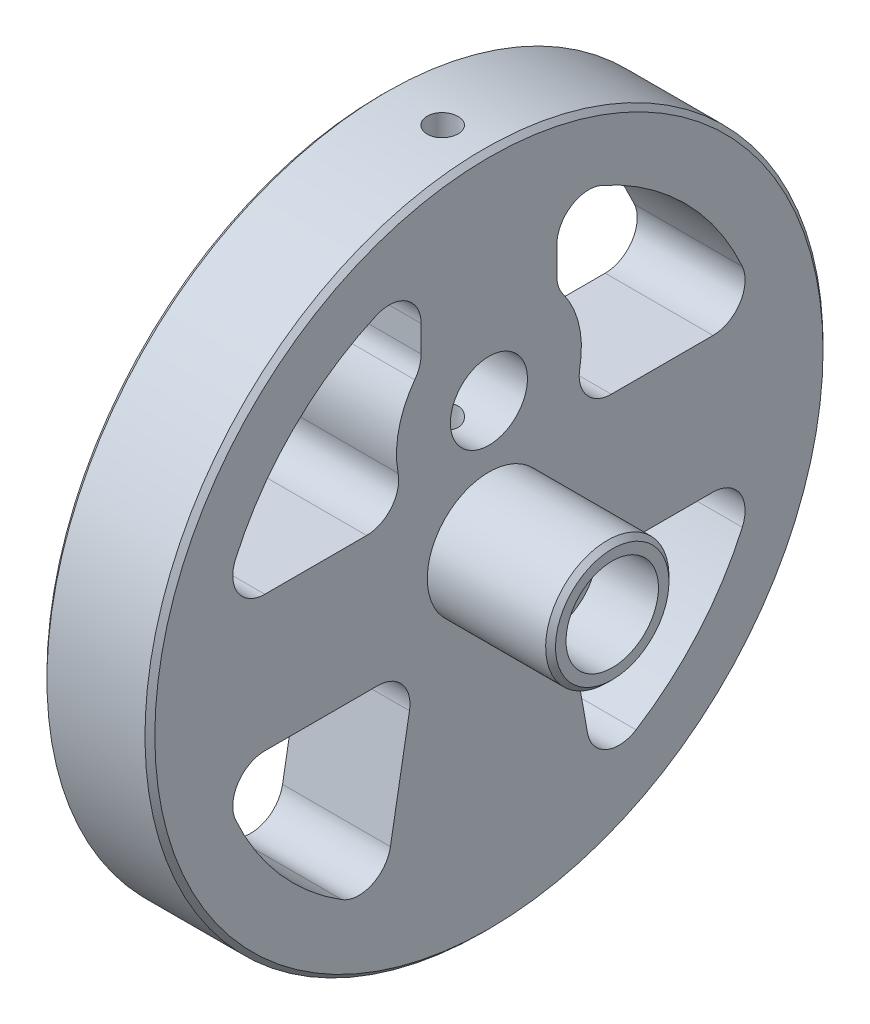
ISO-10303-21;
HEADER;
FILE_DESCRIPTION(('STEP AP214'),'2;1');
FILE_NAME('part.step','',(''),(''),'','','');
FILE_SCHEMA(('AUTOMOTIVE_DESIGN { 1 0 10303 214 1 1 1 1 }'));
ENDSEC;
DATA;
#1=APPLICATION_CONTEXT('core data for automotive mechanical design processes');
#2=APPLICATION_PROTOCOL_DEFINITION('international standard','automotive_design',2000,#1);
#3=PRODUCT_CONTEXT('',#1,'mechanical');
#4=PRODUCT('Part','Part','',(#3));
#5=PRODUCT_RELATED_PRODUCT_CATEGORY('part','',(#4));
#6=PRODUCT_DEFINITION_FORMATION('','',#4);
#7=PRODUCT_DEFINITION_CONTEXT('part definition',#1,'design');
#8=PRODUCT_DEFINITION('design','',#6,#7);
#9=PRODUCT_DEFINITION_SHAPE('','',#8);
#10=(LENGTH_UNIT() NAMED_UNIT(*) SI_UNIT(.MILLI.,.METRE.));
#11=(NAMED_UNIT(*) PLANE_ANGLE_UNIT() SI_UNIT($,.RADIAN.));
#12=(NAMED_UNIT(*) SI_UNIT($,.STERADIAN.) SOLID_ANGLE_UNIT());
#13=UNCERTAINTY_MEASURE_WITH_UNIT(LENGTH_MEASURE(1.E-05),#10,'distance_accuracy_value','');
#14=(GEOMETRIC_REPRESENTATION_CONTEXT(3) GLOBAL_UNCERTAINTY_ASSIGNED_CONTEXT((#13)) GLOBAL_UNIT_ASSIGNED_CONTEXT((#10,
#11,#12)) REPRESENTATION_CONTEXT('',''));
#15=CARTESIAN_POINT('',(0.,0.,0.));
#16=DIRECTION('',(0.,0.,1.));
#17=DIRECTION('',(1.,0.,0.));
#18=AXIS2_PLACEMENT_3D('',#15,#16,#17);
#19=CARTESIAN_POINT('',(0.,0.,0.));
#20=DIRECTION('',(-1.,0.,0.));
#21=DIRECTION('',(0.,-1.,0.));
#22=AXIS2_PLACEMENT_3D('',#19,#20,#21);
#23=CYLINDRICAL_SURFACE('',#22,34.925);
#24=CARTESIAN_POINT('',(0.507999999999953,0.,0.));
#25=DIRECTION('',(1.,0.,0.));
#26=DIRECTION('',(0.,1.,0.));
#27=AXIS2_PLACEMENT_3D('',#24,#25,#26);
#28=CIRCLE('',#27,34.925);
#29=CARTESIAN_POINT('',(0.507999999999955,34.925,0.));
#30=VERTEX_POINT('',#29);
#31=EDGE_CURVE('E44',#30,#30,#28,.T.);
#32=ORIENTED_EDGE('',*,*,#31,.T.);
#33=EDGE_LOOP('',(#32));
#34=FACE_BOUND('',#33,.T.);
#35=CARTESIAN_POINT('',(10.6045,0.,0.));
#36=DIRECTION('',(-1.,0.,0.));
#37=DIRECTION('',(0.,-1.,0.));
#38=AXIS2_PLACEMENT_3D('',#35,#36,#37);
#39=CIRCLE('',#38,34.925);
#40=CARTESIAN_POINT('',(10.6045,-34.925,0.));
#41=VERTEX_POINT('',#40);
#42=EDGE_CURVE('E320',#41,#41,#39,.T.);
#43=ORIENTED_EDGE('',*,*,#42,.T.);
#44=EDGE_LOOP('',(#43));
#45=FACE_BOUND('',#44,.T.);
#46=CARTESIAN_POINT('',(4.7625,34.925,0.));
#47=CARTESIAN_POINT('',(4.76250393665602,34.9249995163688,0.0891211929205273));
#48=CARTESIAN_POINT('',(4.77003000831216,34.9246552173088,0.17830583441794));
#49=CARTESIAN_POINT('',(4.79994666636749,34.9233148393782,0.354215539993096));
#50=CARTESIAN_POINT('',(4.82235483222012,34.9223179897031,0.440937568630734));
#51=CARTESIAN_POINT('',(4.88139341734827,34.9197853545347,0.609348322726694));
#52=CARTESIAN_POINT('',(4.91801666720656,34.9182498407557,0.691039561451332));
#53=CARTESIAN_POINT('',(5.00443499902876,34.914812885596,0.847092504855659));
#54=CARTESIAN_POINT('',(5.05422694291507,34.9129115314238,0.921455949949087));
#55=CARTESIAN_POINT('',(5.16561729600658,34.908955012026,1.06082869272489));
#56=CARTESIAN_POINT('',(5.2272245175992,34.9068997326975,1.12583094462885));
#57=CARTESIAN_POINT('',(5.36047934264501,34.902867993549,1.24457619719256));
#58=CARTESIAN_POINT('',(5.43212735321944,34.9008915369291,1.29831874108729));
#59=CARTESIAN_POINT('',(5.58346534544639,34.8972395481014,1.39303724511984));
#60=CARTESIAN_POINT('',(5.66315865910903,34.8955641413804,1.43400788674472));
#61=CARTESIAN_POINT('',(5.82830156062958,34.8927045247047,1.5019854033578));
#62=CARTESIAN_POINT('',(5.91375111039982,34.8915203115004,1.52899237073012));
#63=CARTESIAN_POINT('',(6.08791771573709,34.8897776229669,1.56825779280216));
#64=CARTESIAN_POINT('',(6.17663245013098,34.8892187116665,1.58052652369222));
#65=CARTESIAN_POINT('',(6.35486385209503,34.8887883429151,1.58999890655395));
#66=CARTESIAN_POINT('',(6.4443805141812,34.8889168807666,1.58720266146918));
#67=CARTESIAN_POINT('',(6.62160492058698,34.8898465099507,1.56663304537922));
#68=CARTESIAN_POINT('',(6.70931395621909,34.890647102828,1.54887077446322));
#69=CARTESIAN_POINT('',(6.88050409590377,34.8928298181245,1.49889050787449));
#70=CARTESIAN_POINT('',(6.96398518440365,34.8942119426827,1.4666724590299));
#71=CARTESIAN_POINT('',(7.12438548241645,34.8974025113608,1.38868249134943));
#72=CARTESIAN_POINT('',(7.20130222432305,34.8992111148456,1.34290550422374));
#73=CARTESIAN_POINT('',(7.34636344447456,34.9030506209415,1.23910080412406));
#74=CARTESIAN_POINT('',(7.41450787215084,34.905081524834,1.18107302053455));
#75=CARTESIAN_POINT('',(7.54015471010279,34.9091389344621,1.05435124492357));
#76=CARTESIAN_POINT('',(7.59764742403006,34.911165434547,0.98564763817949));
#77=CARTESIAN_POINT('',(7.70028412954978,34.9149838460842,0.839558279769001));
#78=CARTESIAN_POINT('',(7.74542811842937,34.9167757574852,0.762172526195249));
#79=CARTESIAN_POINT('',(7.82208493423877,34.9199230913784,0.600909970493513));
#80=CARTESIAN_POINT('',(7.8535974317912,34.9212785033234,0.517033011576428));
#81=CARTESIAN_POINT('',(7.90209044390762,34.9233999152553,0.345171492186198));
#82=CARTESIAN_POINT('',(7.91907104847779,34.9241659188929,0.257186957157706));
#83=CARTESIAN_POINT('',(7.93800632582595,34.9250217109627,0.0796920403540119));
#84=CARTESIAN_POINT('',(7.93997441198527,34.9251121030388,-0.00981690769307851));
#85=CARTESIAN_POINT('',(7.92886377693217,34.9246080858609,-0.187893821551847));
#86=CARTESIAN_POINT('',(7.91578509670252,34.9240136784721,-0.276461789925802));
#87=CARTESIAN_POINT('',(7.8749632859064,34.9222074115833,-0.45010509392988));
#88=CARTESIAN_POINT('',(7.84722627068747,34.9209958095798,-0.535181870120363));
#89=CARTESIAN_POINT('',(7.7778813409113,34.9180915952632,-0.699472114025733));
#90=CARTESIAN_POINT('',(7.73627336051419,34.916398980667,-0.778685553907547));
#91=CARTESIAN_POINT('',(7.6403331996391,34.9127217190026,-0.929062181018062));
#92=CARTESIAN_POINT('',(7.58599201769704,34.9107368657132,-1.00021962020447));
#93=CARTESIAN_POINT('',(7.46614116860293,34.9066993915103,-1.13240657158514));
#94=CARTESIAN_POINT('',(7.40063144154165,34.9046467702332,-1.1934360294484));
#95=CARTESIAN_POINT('',(7.26024543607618,34.9007034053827,-1.30367968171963));
#96=CARTESIAN_POINT('',(7.18536234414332,34.8988127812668,-1.35288520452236));
#97=CARTESIAN_POINT('',(7.02838976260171,34.895408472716,-1.43802496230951));
#98=CARTESIAN_POINT('',(6.94630030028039,34.8938947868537,-1.47395924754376));
#99=CARTESIAN_POINT('',(6.77727746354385,34.8914158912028,-1.53152134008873));
#100=CARTESIAN_POINT('',(6.69034598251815,34.8904504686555,-1.55315469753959));
#101=CARTESIAN_POINT('',(6.51408020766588,34.8891763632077,-1.58151900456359));
#102=CARTESIAN_POINT('',(6.42474592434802,34.8888676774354,-1.58825001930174));
#103=CARTESIAN_POINT('',(6.24629679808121,34.8889419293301,-1.58661792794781));
#104=CARTESIAN_POINT('',(6.15718182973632,34.8893242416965,-1.57826846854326));
#105=CARTESIAN_POINT('',(5.98162016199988,34.8907360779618,-1.54674061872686));
#106=CARTESIAN_POINT('',(5.89517346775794,34.8917656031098,-1.52356219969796));
#107=CARTESIAN_POINT('',(5.72739904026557,34.8943556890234,-1.46303703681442));
#108=CARTESIAN_POINT('',(5.64607136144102,34.895916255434,-1.4256901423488));
#109=CARTESIAN_POINT('',(5.49084023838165,34.8993924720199,-1.33789080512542));
#110=CARTESIAN_POINT('',(5.41693655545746,34.9013081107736,-1.28743878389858));
#111=CARTESIAN_POINT('',(5.27858375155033,34.9052805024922,-1.17481347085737));
#112=CARTESIAN_POINT('',(5.21414220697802,34.9073373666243,-1.11263087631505));
#113=CARTESIAN_POINT('',(5.09659345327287,34.9113596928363,-0.978311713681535));
#114=CARTESIAN_POINT('',(5.04348904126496,34.9133251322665,-0.906172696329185));
#115=CARTESIAN_POINT('',(4.9501014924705,34.9169442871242,-0.753939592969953));
#116=CARTESIAN_POINT('',(4.90982959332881,34.9185977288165,-0.673838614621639));
#117=CARTESIAN_POINT('',(4.84335371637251,34.9214022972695,-0.508065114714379));
#118=CARTESIAN_POINT('',(4.81713307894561,34.9225540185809,-0.422399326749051));
#119=CARTESIAN_POINT('',(4.78640105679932,34.9239198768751,-0.280165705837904));
#120=CARTESIAN_POINT('',(4.77744955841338,34.9243231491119,-0.224519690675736));
#121=CARTESIAN_POINT('',(4.76549778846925,34.9248633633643,-0.112590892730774));
#122=CARTESIAN_POINT('',(4.76249751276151,34.9250003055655,-0.0563081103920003));
#123=CARTESIAN_POINT('',(4.7625,34.925,0.));
#124=B_SPLINE_CURVE_WITH_KNOTS('',3,(#46,#47,#48,#49,#50,#51,#52,#53,#54,#55,#56,#57,#58,#59,
#60,#61,#62,#63,#64,#65,#66,#67,#68,#69,#70,#71,#72,#73,#74,#75,#76,#77,#78,#79,#80,#81,#82,#83,
#84,#85,#86,#87,#88,#89,#90,#91,#92,#93,#94,#95,#96,#97,#98,#99,#100,#101,#102,#103,#104,#105,
#106,#107,#108,#109,#110,#111,#112,#113,#114,#115,#116,#117,#118,#119,#120,#121,#122,#123),
.UNSPECIFIED.,.T.,.F.,(4,2,2,2,2,2,2,2,2,2,2,2,2,2,2,2,2,2,2,2,2,2,2,2,2,2,2,2,2,2,2,2,2,2,2,2,
2,2,4),(0.,0.26715803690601,0.534632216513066,0.801971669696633,1.06924747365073,
1.33672340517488,1.60421018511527,1.87180820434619,2.13940445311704,2.40681401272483,
2.67422174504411,2.94143131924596,3.20864187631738,3.47595244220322,3.74326454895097,
4.01081880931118,4.27837312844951,4.5459339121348,4.81349303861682,5.08081307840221,
5.34813239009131,5.61534026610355,5.8825494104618,6.14994802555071,6.41734807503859,
6.68494363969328,6.95253819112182,7.22002882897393,7.48751829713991,7.75476582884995,
8.02201387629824,8.28926476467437,8.55650705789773,8.82396218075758,9.09148321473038,
9.35923788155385,9.62667438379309,9.79546896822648,9.96426343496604),.UNSPECIFIED.);
#125=CARTESIAN_POINT('',(4.7625,34.925,0.));
#126=VERTEX_POINT('',#125);
#127=EDGE_CURVE('E245',#126,#126,#124,.T.);
#128=ORIENTED_EDGE('',*,*,#127,.F.);
#129=EDGE_LOOP('',(#128));
#130=FACE_BOUND('',#129,.T.);
#131=ADVANCED_FACE('F36',(#34,#45,#130),#23,.T.);
#132=CARTESIAN_POINT('',(23.8125,12.7,0.));
#133=DIRECTION('',(-1.,0.,0.));
#134=DIRECTION('',(0.,0.,1.));
#135=AXIS2_PLACEMENT_3D('',#132,#133,#134);
#136=CYLINDRICAL_SURFACE('',#135,3.96875);
#137=CARTESIAN_POINT('',(6.34999999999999,9.0625805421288,-1.5875));
#138=CARTESIAN_POINT('',(6.26495802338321,9.06257195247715,-1.58749067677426));
#139=CARTESIAN_POINT('',(6.17979576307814,9.05955609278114,-1.58062598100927));
#140=CARTESIAN_POINT('',(6.01191422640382,9.04786961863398,-1.55342354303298));
#141=CARTESIAN_POINT('',(5.92920175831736,9.03918455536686,-1.53305137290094));
#142=CARTESIAN_POINT('',(5.76893297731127,9.01731388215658,-1.47973655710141));
#143=CARTESIAN_POINT('',(5.6913585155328,9.0041452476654,-1.44684127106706));
#144=CARTESIAN_POINT('',(5.54284749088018,8.97481484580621,-1.36955233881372));
#145=CARTESIAN_POINT('',(5.47190948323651,8.95865373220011,-1.32516120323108));
#146=CARTESIAN_POINT('',(5.33458705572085,8.92412438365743,-1.22342431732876));
#147=CARTESIAN_POINT('',(5.26862958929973,8.90568515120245,-1.16552611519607));
#148=CARTESIAN_POINT('',(5.14704885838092,8.86926362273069,-1.03958160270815));
#149=CARTESIAN_POINT('',(5.09142920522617,8.85128148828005,-0.971531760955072));
#150=CARTESIAN_POINT('',(4.98998367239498,8.81694794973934,-0.823917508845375));
#151=CARTESIAN_POINT('',(4.94463046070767,8.80068880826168,-0.744004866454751));
#152=CARTESIAN_POINT('',(4.86819291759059,8.7724938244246,-0.57691760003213));
#153=CARTESIAN_POINT('',(4.83710277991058,8.76055622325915,-0.489745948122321));
#154=CARTESIAN_POINT('',(4.79159769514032,8.74285204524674,-0.315092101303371));
#155=CARTESIAN_POINT('',(4.77644831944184,8.7368146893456,-0.227829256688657));
#156=CARTESIAN_POINT('',(4.76088988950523,8.73061253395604,-0.0518051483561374));
#157=CARTESIAN_POINT('',(4.76047533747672,8.73044554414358,0.0369555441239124));
#158=CARTESIAN_POINT('',(4.77399569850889,8.73583817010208,0.208147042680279));
#159=CARTESIAN_POINT('',(4.78712591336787,8.74107665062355,0.290653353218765));
#160=CARTESIAN_POINT('',(4.82599434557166,8.75625874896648,0.452178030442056));
#161=CARTESIAN_POINT('',(4.85173348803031,8.76620271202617,0.531196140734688));
#162=CARTESIAN_POINT('',(4.91540520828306,8.79001270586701,0.684925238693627));
#163=CARTESIAN_POINT('',(4.95351571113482,8.80393558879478,0.759553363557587));
#164=CARTESIAN_POINT('',(5.04068159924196,8.83432173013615,0.901547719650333));
#165=CARTESIAN_POINT('',(5.08974073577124,8.85078585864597,0.968911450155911));
#166=CARTESIAN_POINT('',(5.20116525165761,8.88585950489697,1.09916025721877));
#167=CARTESIAN_POINT('',(5.26419277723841,8.90453890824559,1.16146091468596));
#168=CARTESIAN_POINT('',(5.39987376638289,8.94110431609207,1.27484776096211));
#169=CARTESIAN_POINT('',(5.47253036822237,8.95899005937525,1.32593027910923));
#170=CARTESIAN_POINT('',(5.6280200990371,8.99241837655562,1.4167676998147));
#171=CARTESIAN_POINT('',(5.71108270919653,9.00788049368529,1.45616187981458));
#172=CARTESIAN_POINT('',(5.88344604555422,9.03376725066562,1.52017115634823));
#173=CARTESIAN_POINT('',(5.97274267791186,9.04419516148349,1.54479585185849));
#174=CARTESIAN_POINT('',(6.14920964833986,9.05803878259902,1.57714549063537));
#175=CARTESIAN_POINT('',(6.23617660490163,9.0618439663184,1.58581097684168));
#176=CARTESIAN_POINT('',(6.41038628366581,9.06312086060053,1.58873930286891));
#177=CARTESIAN_POINT('',(6.49762891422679,9.06059449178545,1.5830065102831));
#178=CARTESIAN_POINT('',(6.66468927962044,9.04989264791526,1.55815736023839));
#179=CARTESIAN_POINT('',(6.74464689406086,9.0420471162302,1.53982186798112));
#180=CARTESIAN_POINT('',(6.90029767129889,9.02200021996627,1.49130082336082));
#181=CARTESIAN_POINT('',(6.97598988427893,9.0097978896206,1.46111264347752));
#182=CARTESIAN_POINT('',(7.12438437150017,8.98180685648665,1.3883764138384));
#183=CARTESIAN_POINT('',(7.19684091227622,8.96589278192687,1.34537677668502));
#184=CARTESIAN_POINT('',(7.33383962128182,8.93246256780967,1.24869989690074));
#185=CARTESIAN_POINT('',(7.3983785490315,8.9149457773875,1.19501830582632));
#186=CARTESIAN_POINT('',(7.52266514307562,8.87872147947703,1.07382009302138));
#187=CARTESIAN_POINT('',(7.58170677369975,8.86002159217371,1.00557443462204));
#188=CARTESIAN_POINT('',(7.68760930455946,8.82475538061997,0.859697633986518));
#189=CARTESIAN_POINT('',(7.73446970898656,8.80818914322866,0.782066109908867));
#190=CARTESIAN_POINT('',(7.8145065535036,8.77900425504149,0.619347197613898));
#191=CARTESIAN_POINT('',(7.84768627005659,8.76638465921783,0.534261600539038));
#192=CARTESIAN_POINT('',(7.89904190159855,8.74654783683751,0.359087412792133));
#193=CARTESIAN_POINT('',(7.91722595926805,8.73932767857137,0.269001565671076));
#194=CARTESIAN_POINT('',(7.93710685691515,8.73141662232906,0.092723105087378));
#195=CARTESIAN_POINT('',(7.93980197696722,8.73033046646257,0.00665995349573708));
#196=CARTESIAN_POINT('',(7.93126471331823,8.73374203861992,-0.164650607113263));
#197=CARTESIAN_POINT('',(7.92003443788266,8.73823892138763,-0.249898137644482));
#198=CARTESIAN_POINT('',(7.88467848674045,8.75211361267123,-0.414473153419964));
#199=CARTESIAN_POINT('',(7.86095952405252,8.761337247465,-0.493902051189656));
#200=CARTESIAN_POINT('',(7.80172683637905,8.7836776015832,-0.647638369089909));
#201=CARTESIAN_POINT('',(7.76621093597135,8.79679503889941,-0.721944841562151));
#202=CARTESIAN_POINT('',(7.68262433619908,8.82635637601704,-0.866936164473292));
#203=CARTESIAN_POINT('',(7.63406819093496,8.84292165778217,-0.937315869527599));
#204=CARTESIAN_POINT('',(7.52650536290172,8.87738411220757,-1.06922413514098));
#205=CARTESIAN_POINT('',(7.46749435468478,8.89528183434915,-1.13074901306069));
#206=CARTESIAN_POINT('',(7.33638104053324,8.93176900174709,-1.24714100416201));
#207=CARTESIAN_POINT('',(7.26369445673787,8.95033267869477,-1.30136017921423));
#208=CARTESIAN_POINT('',(7.10966467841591,8.98485573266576,-1.39687891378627));
#209=CARTESIAN_POINT('',(7.0283204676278,9.00081480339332,-1.43817695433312));
#210=CARTESIAN_POINT('',(6.86670172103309,9.02685151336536,-1.50335542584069));
#211=CARTESIAN_POINT('',(6.78698696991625,9.03732858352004,-1.52846683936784));
#212=CARTESIAN_POINT('',(6.62425219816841,9.05314734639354,-1.56584472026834));
#213=CARTESIAN_POINT('',(6.54124206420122,9.05850334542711,-1.57814698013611));
#214=CARTESIAN_POINT('',(6.42193155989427,9.06204960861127,-1.5862810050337));
#215=CARTESIAN_POINT('',(6.38597654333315,9.06258417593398,-1.58750394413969));
#216=CARTESIAN_POINT('',(6.34999999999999,9.0625805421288,-1.5875));
#217=B_SPLINE_CURVE_WITH_KNOTS('',3,(#137,#138,#139,#140,#141,#142,#143,#144,#145,#146,#147,
#148,#149,#150,#151,#152,#153,#154,#155,#156,#157,#158,#159,#160,#161,#162,#163,#164,#165,#166,
#167,#168,#169,#170,#171,#172,#173,#174,#175,#176,#177,#178,#179,#180,#181,#182,#183,#184,#185,
#186,#187,#188,#189,#190,#191,#192,#193,#194,#195,#196,#197,#198,#199,#200,#201,#202,#203,#204,
#205,#206,#207,#208,#209,#210,#211,#212,#213,#214,#215,#216),.UNSPECIFIED.,.T.,.F.,(4,2,2,2,2,2,
2,2,2,2,2,2,2,2,2,2,2,2,2,2,2,2,2,2,2,2,2,2,2,2,2,2,2,2,2,2,2,2,2,4),(0.,0.255014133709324,
0.510680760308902,0.765389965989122,1.02004359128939,1.28790397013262,1.55585774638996,
1.83437743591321,2.11278364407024,2.37771132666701,2.64254015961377,2.89249361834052,
3.14246541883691,3.3962046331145,3.6500309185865,3.92052209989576,4.19110165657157,
4.46932414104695,4.74736560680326,5.00842079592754,5.26939680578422,5.51550878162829,
5.76167534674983,6.01782479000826,6.27407872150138,6.54926089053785,6.82445425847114,
7.0995816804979,7.37455960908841,7.63159700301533,7.88859548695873,8.13769958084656,
8.38684963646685,8.6470097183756,8.90727768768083,9.18365776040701,9.46007031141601,
9.71166349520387,9.9625517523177,10.0704340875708),.UNSPECIFIED.);
#218=CARTESIAN_POINT('',(6.34999999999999,9.0625805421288,-1.5875));
#219=VERTEX_POINT('',#218);
#220=EDGE_CURVE('E244',#219,#219,#217,.T.);
#221=ORIENTED_EDGE('',*,*,#220,.F.);
#222=EDGE_LOOP('',(#221));
#223=FACE_BOUND('',#222,.T.);
#224=CARTESIAN_POINT('',(0.,12.7,0.));
#225=DIRECTION('',(-1.,0.,0.));
#226=DIRECTION('',(0.,0.,1.));
#227=AXIS2_PLACEMENT_3D('',#224,#225,#226);
#228=CIRCLE('',#227,3.96875);
#229=CARTESIAN_POINT('',(0.,12.7,3.96875));
#230=VERTEX_POINT('',#229);
#231=EDGE_CURVE('E349',#230,#230,#228,.T.);
#232=ORIENTED_EDGE('',*,*,#231,.T.);
#233=EDGE_LOOP('',(#232));
#234=FACE_BOUND('',#233,.T.);
#235=CARTESIAN_POINT('',(11.1125,12.7,0.));
#236=DIRECTION('',(-1.,0.,0.));
#237=DIRECTION('',(0.,-1.,0.));
#238=AXIS2_PLACEMENT_3D('',#235,#236,#237);
#239=CIRCLE('',#238,3.96875);
#240=CARTESIAN_POINT('',(11.1125,8.73125,0.));
#241=VERTEX_POINT('',#240);
#242=EDGE_CURVE('E346',#241,#241,#239,.T.);
#243=ORIENTED_EDGE('',*,*,#242,.F.);
#244=EDGE_LOOP('',(#243));
#245=FACE_BOUND('',#244,.T.);
#246=CARTESIAN_POINT('',(6.34999999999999,16.3374194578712,-1.5875));
#247=CARTESIAN_POINT('',(6.43504197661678,16.3374280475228,-1.58749067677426));
#248=CARTESIAN_POINT('',(6.52020423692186,16.3404439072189,-1.58062598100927));
#249=CARTESIAN_POINT('',(6.68808577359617,16.352130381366,-1.55342354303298));
#250=CARTESIAN_POINT('',(6.77079824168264,16.3608154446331,-1.53305137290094));
#251=CARTESIAN_POINT('',(6.93106702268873,16.3826861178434,-1.47973655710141));
#252=CARTESIAN_POINT('',(7.0086414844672,16.3958547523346,-1.44684127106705));
#253=CARTESIAN_POINT('',(7.15715250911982,16.4251851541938,-1.36955233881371));
#254=CARTESIAN_POINT('',(7.22809051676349,16.4413462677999,-1.32516120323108));
#255=CARTESIAN_POINT('',(7.36541294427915,16.4758756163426,-1.22342431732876));
#256=CARTESIAN_POINT('',(7.43137041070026,16.4943148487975,-1.16552611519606));
#257=CARTESIAN_POINT('',(7.55295114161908,16.5307363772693,-1.03958160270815));
#258=CARTESIAN_POINT('',(7.60857079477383,16.54871851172,-0.971531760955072));
#259=CARTESIAN_POINT('',(7.71001632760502,16.5830520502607,-0.823917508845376));
#260=CARTESIAN_POINT('',(7.75536953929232,16.5993111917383,-0.744004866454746));
#261=CARTESIAN_POINT('',(7.83180708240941,16.6275061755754,-0.576917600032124));
#262=CARTESIAN_POINT('',(7.86289722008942,16.6394437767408,-0.489745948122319));
#263=CARTESIAN_POINT('',(7.90840230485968,16.6571479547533,-0.315092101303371));
#264=CARTESIAN_POINT('',(7.92355168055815,16.6631853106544,-0.227829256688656));
#265=CARTESIAN_POINT('',(7.93911011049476,16.669387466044,-0.0518051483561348));
#266=CARTESIAN_POINT('',(7.93952466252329,16.6695544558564,0.0369555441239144));
#267=CARTESIAN_POINT('',(7.92600430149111,16.6641618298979,0.208147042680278));
#268=CARTESIAN_POINT('',(7.91287408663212,16.6589233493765,0.290653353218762));
#269=CARTESIAN_POINT('',(7.87400565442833,16.6437412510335,0.452178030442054));
#270=CARTESIAN_POINT('',(7.8482665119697,16.6337972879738,0.531196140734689));
#271=CARTESIAN_POINT('',(7.78459479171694,16.609987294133,0.684925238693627));
#272=CARTESIAN_POINT('',(7.74648428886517,16.5960644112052,0.759553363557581));
#273=CARTESIAN_POINT('',(7.65931840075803,16.5656782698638,0.901547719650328));
#274=CARTESIAN_POINT('',(7.61025926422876,16.549214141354,0.968911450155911));
#275=CARTESIAN_POINT('',(7.49883474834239,16.514140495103,1.09916025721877));
#276=CARTESIAN_POINT('',(7.43580722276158,16.4954610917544,1.16146091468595));
#277=CARTESIAN_POINT('',(7.30012623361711,16.4588956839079,1.2748477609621));
#278=CARTESIAN_POINT('',(7.22746963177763,16.4410099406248,1.32593027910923));
#279=CARTESIAN_POINT('',(7.0719799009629,16.4075816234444,1.4167676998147));
#280=CARTESIAN_POINT('',(6.98891729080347,16.3921195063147,1.45616187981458));
#281=CARTESIAN_POINT('',(6.81655395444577,16.3662327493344,1.52017115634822));
#282=CARTESIAN_POINT('',(6.72725732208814,16.3558048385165,1.54479585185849));
#283=CARTESIAN_POINT('',(6.55079035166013,16.341961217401,1.57714549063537));
#284=CARTESIAN_POINT('',(6.46382339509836,16.3381560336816,1.58581097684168));
#285=CARTESIAN_POINT('',(6.28961371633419,16.3368791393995,1.58873930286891));
#286=CARTESIAN_POINT('',(6.20237108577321,16.3394055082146,1.5830065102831));
#287=CARTESIAN_POINT('',(6.03531072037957,16.3501073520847,1.55815736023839));
#288=CARTESIAN_POINT('',(5.95535310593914,16.3579528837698,1.53982186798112));
#289=CARTESIAN_POINT('',(5.79970232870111,16.3779997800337,1.49130082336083));
#290=CARTESIAN_POINT('',(5.72401011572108,16.3902021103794,1.46111264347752));
#291=CARTESIAN_POINT('',(5.57561562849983,16.4181931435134,1.3883764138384));
#292=CARTESIAN_POINT('',(5.50315908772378,16.4341072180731,1.34537677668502));
#293=CARTESIAN_POINT('',(5.36616037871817,16.4675374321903,1.24869989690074));
#294=CARTESIAN_POINT('',(5.30162145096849,16.4850542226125,1.19501830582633));
#295=CARTESIAN_POINT('',(5.17733485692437,16.521278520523,1.07382009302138));
#296=CARTESIAN_POINT('',(5.11829322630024,16.5399784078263,1.00557443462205));
#297=CARTESIAN_POINT('',(5.01239069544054,16.57524461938,0.859697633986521));
#298=CARTESIAN_POINT('',(4.96553029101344,16.5918108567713,0.782066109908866));
#299=CARTESIAN_POINT('',(4.8854934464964,16.6209957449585,0.619347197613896));
#300=CARTESIAN_POINT('',(4.8523137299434,16.6336153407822,0.534261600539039));
#301=CARTESIAN_POINT('',(4.80095809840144,16.6534521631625,0.359087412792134));
#302=CARTESIAN_POINT('',(4.78277404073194,16.6606723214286,0.269001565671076));
#303=CARTESIAN_POINT('',(4.76289314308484,16.6685833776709,0.0927231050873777));
#304=CARTESIAN_POINT('',(4.76019802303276,16.6696695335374,0.00665995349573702));
#305=CARTESIAN_POINT('',(4.76873528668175,16.6662579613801,-0.164650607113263));
#306=CARTESIAN_POINT('',(4.77996556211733,16.6617610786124,-0.249898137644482));
#307=CARTESIAN_POINT('',(4.81532151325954,16.6478863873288,-0.414473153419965));
#308=CARTESIAN_POINT('',(4.83904047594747,16.638662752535,-0.493902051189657));
#309=CARTESIAN_POINT('',(4.89827316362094,16.6163223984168,-0.64763836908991));
#310=CARTESIAN_POINT('',(4.93378906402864,16.6032049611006,-0.721944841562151));
#311=CARTESIAN_POINT('',(5.01737566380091,16.573643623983,-0.866936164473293));
#312=CARTESIAN_POINT('',(5.06593180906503,16.5570783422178,-0.937315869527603));
#313=CARTESIAN_POINT('',(5.17349463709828,16.5226158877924,-1.06922413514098));
#314=CARTESIAN_POINT('',(5.23250564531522,16.5047181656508,-1.13074901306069));
#315=CARTESIAN_POINT('',(5.36361895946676,16.4682309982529,-1.24714100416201));
#316=CARTESIAN_POINT('',(5.43630554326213,16.4496673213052,-1.30136017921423));
#317=CARTESIAN_POINT('',(5.59033532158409,16.4151442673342,-1.39687891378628));
#318=CARTESIAN_POINT('',(5.6716795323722,16.3991851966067,-1.43817695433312));
#319=CARTESIAN_POINT('',(5.83329827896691,16.3731484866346,-1.50335542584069));
#320=CARTESIAN_POINT('',(5.91301303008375,16.36267141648,-1.52846683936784));
#321=CARTESIAN_POINT('',(6.07574780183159,16.3468526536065,-1.56584472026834));
#322=CARTESIAN_POINT('',(6.15875793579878,16.3414966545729,-1.57814698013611));
#323=CARTESIAN_POINT('',(6.27806844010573,16.3379503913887,-1.5862810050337));
#324=CARTESIAN_POINT('',(6.31402345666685,16.337415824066,-1.58750394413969));
#325=CARTESIAN_POINT('',(6.34999999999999,16.3374194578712,-1.5875));
#326=B_SPLINE_CURVE_WITH_KNOTS('',3,(#246,#247,#248,#249,#250,#251,#252,#253,#254,#255,#256,
#257,#258,#259,#260,#261,#262,#263,#264,#265,#266,#267,#268,#269,#270,#271,#272,#273,#274,#275,
#276,#277,#278,#279,#280,#281,#282,#283,#284,#285,#286,#287,#288,#289,#290,#291,#292,#293,#294,
#295,#296,#297,#298,#299,#300,#301,#302,#303,#304,#305,#306,#307,#308,#309,#310,#311,#312,#313,
#314,#315,#316,#317,#318,#319,#320,#321,#322,#323,#324,#325),.UNSPECIFIED.,.T.,.F.,(4,2,2,2,2,2,
2,2,2,2,2,2,2,2,2,2,2,2,2,2,2,2,2,2,2,2,2,2,2,2,2,2,2,2,2,2,2,2,2,4),(0.,0.255014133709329,
0.510680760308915,0.765389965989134,1.0200435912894,1.28790397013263,1.55585774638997,
1.83437743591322,2.11278364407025,2.37771132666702,2.64254015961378,2.89249361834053,
3.14246541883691,3.39620463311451,3.6500309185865,3.92052209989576,4.19110165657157,
4.46932414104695,4.74736560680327,5.00842079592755,5.26939680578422,5.51550878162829,
5.76167534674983,6.01782479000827,6.27407872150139,6.54926089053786,6.82445425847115,
7.09958168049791,7.37455960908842,7.63159700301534,7.88859548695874,8.13769958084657,
8.38684963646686,8.64700971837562,8.90727768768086,9.18365776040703,9.46007031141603,
9.71166349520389,9.96255175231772,10.0704340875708),.UNSPECIFIED.);
#327=CARTESIAN_POINT('',(6.34999999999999,16.3374194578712,-1.5875));
#328=VERTEX_POINT('',#327);
#329=EDGE_CURVE('E253',#328,#328,#326,.T.);
#330=ORIENTED_EDGE('',*,*,#329,.F.);
#331=EDGE_LOOP('',(#330));
#332=FACE_BOUND('',#331,.T.);
#333=ADVANCED_FACE('F287',(#223,#234,#245,#332),#136,.F.);
#334=CARTESIAN_POINT('',(17.4625,4.7625,0.));
#335=DIRECTION('',(-1.,0.,0.));
#336=DIRECTION('',(0.,-1.,0.));
#337=AXIS2_PLACEMENT_3D('',#334,#335,#336);
#338=PLANE('',#337);
#339=CARTESIAN_POINT('',(17.4625,0.,0.));
#340=DIRECTION('',(1.,0.,0.));
#341=DIRECTION('',(0.,0.,-1.));
#342=AXIS2_PLACEMENT_3D('',#339,#340,#341);
#343=CIRCLE('',#342,3.17499999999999);
#344=CARTESIAN_POINT('',(17.4625,0.,-3.17499999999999));
#345=VERTEX_POINT('',#344);
#346=EDGE_CURVE('E241',#345,#345,#343,.T.);
#347=ORIENTED_EDGE('',*,*,#346,.F.);
#348=EDGE_LOOP('',(#347));
#349=FACE_BOUND('',#348,.T.);
#350=CARTESIAN_POINT('',(17.4625,0.,0.));
#351=DIRECTION('',(-1.,0.,0.));
#352=DIRECTION('',(0.,-1.,0.));
#353=AXIS2_PLACEMENT_3D('',#350,#351,#352);
#354=CIRCLE('',#353,4.7625);
#355=CARTESIAN_POINT('',(17.4625,-4.7625,0.));
#356=VERTEX_POINT('',#355);
#357=EDGE_CURVE('E334',#356,#356,#354,.T.);
#358=ORIENTED_EDGE('',*,*,#357,.F.);
#359=EDGE_LOOP('',(#358));
#360=FACE_BOUND('',#359,.T.);
#361=ADVANCED_FACE('F291',(#349,#360),#338,.F.);
#362=CARTESIAN_POINT('',(0.,0.,0.));
#363=DIRECTION('',(-1.,0.,0.));
#364=DIRECTION('',(0.,-1.,0.));
#365=AXIS2_PLACEMENT_3D('',#362,#363,#364);
#366=CYLINDRICAL_SURFACE('',#365,4.7625);
#367=CARTESIAN_POINT('',(23.8125,0.,0.));
#368=DIRECTION('',(-1.,0.,0.));
#369=DIRECTION('',(0.,-1.,0.));
#370=AXIS2_PLACEMENT_3D('',#367,#368,#369);
#371=CIRCLE('',#370,4.7625);
#372=CARTESIAN_POINT('',(23.8125,-4.7625,0.));
#373=VERTEX_POINT('',#372);
#374=EDGE_CURVE('E337',#373,#373,#371,.T.);
#375=ORIENTED_EDGE('',*,*,#374,.F.);
#376=EDGE_LOOP('',(#375));
#377=FACE_BOUND('',#376,.T.);
#378=ORIENTED_EDGE('',*,*,#357,.T.);
#379=EDGE_LOOP('',(#378));
#380=FACE_BOUND('',#379,.T.);
#381=ADVANCED_FACE('F719',(#377,#380),#366,.F.);
#382=CARTESIAN_POINT('',(23.8125,6.35,0.));
#383=DIRECTION('',(-1.,0.,0.));
#384=DIRECTION('',(0.,-1.,0.));
#385=AXIS2_PLACEMENT_3D('',#382,#383,#384);
#386=PLANE('',#385);
#387=CARTESIAN_POINT('',(23.8125,0.,0.));
#388=DIRECTION('',(-1.,0.,0.));
#389=DIRECTION('',(0.,-1.,0.));
#390=AXIS2_PLACEMENT_3D('',#387,#388,#389);
#391=CIRCLE('',#390,5.84199999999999);
#392=CARTESIAN_POINT('',(23.8125,-5.84199999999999,0.));
#393=VERTEX_POINT('',#392);
#394=EDGE_CURVE('E326',#393,#393,#391,.F.);
#395=ORIENTED_EDGE('',*,*,#394,.T.);
#396=EDGE_LOOP('',(#395));
#397=FACE_BOUND('',#396,.T.);
#398=ORIENTED_EDGE('',*,*,#374,.T.);
#399=EDGE_LOOP('',(#398));
#400=FACE_BOUND('',#399,.T.);
#401=ADVANCED_FACE('F714',(#397,#400),#386,.F.);
#402=CARTESIAN_POINT('',(0.,0.,0.));
#403=DIRECTION('',(-1.,0.,0.));
#404=DIRECTION('',(0.,-1.,0.));
#405=AXIS2_PLACEMENT_3D('',#402,#403,#404);
#406=CYLINDRICAL_SURFACE('',#405,6.35);
#407=CARTESIAN_POINT('',(23.3045,0.,0.));
#408=DIRECTION('',(-1.,0.,0.));
#409=DIRECTION('',(0.,-1.,0.));
#410=AXIS2_PLACEMENT_3D('',#407,#408,#409);
#411=CIRCLE('',#410,6.35);
#412=CARTESIAN_POINT('',(23.3045,-6.35,0.));
#413=VERTEX_POINT('',#412);
#414=EDGE_CURVE('E330',#413,#413,#411,.T.);
#415=ORIENTED_EDGE('',*,*,#414,.T.);
#416=EDGE_LOOP('',(#415));
#417=FACE_BOUND('',#416,.T.);
#418=CARTESIAN_POINT('',(11.1125,0.,0.));
#419=DIRECTION('',(-1.,0.,0.));
#420=DIRECTION('',(0.,-1.,0.));
#421=AXIS2_PLACEMENT_3D('',#418,#419,#420);
#422=CIRCLE('',#421,6.35);
#423=CARTESIAN_POINT('',(11.1125,-6.35,0.));
#424=VERTEX_POINT('',#423);
#425=EDGE_CURVE('E341',#424,#424,#422,.T.);
#426=ORIENTED_EDGE('',*,*,#425,.F.);
#427=EDGE_LOOP('',(#426));
#428=FACE_BOUND('',#427,.T.);
#429=ADVANCED_FACE('F306',(#417,#428),#406,.T.);
#430=CARTESIAN_POINT('',(11.1125,34.925,0.));
#431=DIRECTION('',(-1.,0.,0.));
#432=DIRECTION('',(0.,-1.,0.));
#433=AXIS2_PLACEMENT_3D('',#430,#431,#432);
#434=PLANE('',#433);
#435=CARTESIAN_POINT('',(11.1125,0.,0.));
#436=DIRECTION('',(-1.,0.,0.));
#437=DIRECTION('',(0.,-1.,0.));
#438=AXIS2_PLACEMENT_3D('',#435,#436,#437);
#439=CIRCLE('',#438,34.417);
#440=CARTESIAN_POINT('',(11.1125,-34.417,0.));
#441=VERTEX_POINT('',#440);
#442=EDGE_CURVE('E11',#441,#441,#439,.F.);
#443=ORIENTED_EDGE('',*,*,#442,.T.);
#444=EDGE_LOOP('',(#443));
#445=FACE_BOUND('',#444,.T.);
#446=CARTESIAN_POINT('',(11.1125,0.,0.));
#447=DIRECTION('',(-1.,0.,0.));
#448=DIRECTION('',(0.,-1.,0.));
#449=AXIS2_PLACEMENT_3D('',#446,#447,#448);
#450=CIRCLE('',#449,28.575);
#451=CARTESIAN_POINT('',(11.1125,-11.6310301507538,-26.1007617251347));
#452=VERTEX_POINT('',#451);
#453=CARTESIAN_POINT('',(11.1125,-24.227382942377,-15.1513874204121));
#454=VERTEX_POINT('',#453);
#455=EDGE_CURVE('E531',#452,#454,#450,.T.);
#456=ORIENTED_EDGE('',*,*,#455,.T.);
#457=CARTESIAN_POINT('',(11.1125,-21.4277742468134,-13.4005604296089));
#458=DIRECTION('',(-1.,0.,0.));
#459=DIRECTION('',(0.,-1.,0.));
#460=AXIS2_PLACEMENT_3D('',#457,#458,#459);
#461=CIRCLE('',#460,3.302);
#462=CARTESIAN_POINT('',(11.1125,-22.0011605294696,-10.1487252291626));
#463=VERTEX_POINT('',#462);
#464=EDGE_CURVE('E528',#454,#463,#461,.T.);
#465=ORIENTED_EDGE('',*,*,#464,.T.);
#466=DIRECTION('',(0.,0.984807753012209,0.173648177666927));
#467=VECTOR('',#466,1.);
#468=CARTESIAN_POINT('',(11.1125,34.944000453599,-0.107756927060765));
#469=LINE('',#468,#467);
#470=CARTESIAN_POINT('',(11.1125,-10.8603862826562,-8.18430614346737));
#471=VERTEX_POINT('',#470);
#472=EDGE_CURVE('E543',#463,#471,#469,.T.);
#473=ORIENTED_EDGE('',*,*,#472,.T.);
#474=CARTESIAN_POINT('',(11.1125,-10.287,-11.4361413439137));
#475=DIRECTION('',(-1.,0.,0.));
#476=DIRECTION('',(0.,-1.,0.));
#477=AXIS2_PLACEMENT_3D('',#474,#475,#476);
#478=CIRCLE('',#477,3.302);
#479=CARTESIAN_POINT('',(11.1125,-6.985,-11.4361413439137));
#480=VERTEX_POINT('',#479);
#481=EDGE_CURVE('E540',#471,#480,#478,.T.);
#482=ORIENTED_EDGE('',*,*,#481,.T.);
#483=DIRECTION('',(0.,0.,-1.));
#484=VECTOR('',#483,1.);
#485=CARTESIAN_POINT('',(11.1125,-6.985,0.));
#486=LINE('',#485,#484);
#487=CARTESIAN_POINT('',(11.1125,-6.985,-23.0846737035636));
#488=VERTEX_POINT('',#487);
#489=EDGE_CURVE('E537',#480,#488,#486,.T.);
#490=ORIENTED_EDGE('',*,*,#489,.T.);
#491=CARTESIAN_POINT('',(11.1125,-10.287,-23.0846737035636));
#492=DIRECTION('',(-1.,0.,0.));
#493=DIRECTION('',(0.,-1.,0.));
#494=AXIS2_PLACEMENT_3D('',#491,#492,#493);
#495=CIRCLE('',#494,3.302);
#496=EDGE_CURVE('E534',#488,#452,#495,.T.);
#497=ORIENTED_EDGE('',*,*,#496,.T.);
#498=EDGE_LOOP('',(#456,#465,#473,#482,#490,#497));
#499=FACE_BOUND('',#498,.T.);
#500=DIRECTION('',(0.,-0.984807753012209,0.173648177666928));
#501=VECTOR('',#500,1.);
#502=CARTESIAN_POINT('',(11.1125,34.944000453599,0.107756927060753));
#503=LINE('',#502,#501);
#504=CARTESIAN_POINT('',(11.1125,-10.8603862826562,8.18430614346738));
#505=VERTEX_POINT('',#504);
#506=CARTESIAN_POINT('',(11.1125,-22.0011605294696,10.1487252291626));
#507=VERTEX_POINT('',#506);
#508=EDGE_CURVE('E483',#505,#507,#503,.T.);
#509=ORIENTED_EDGE('',*,*,#508,.T.);
#510=CARTESIAN_POINT('',(11.1125,-21.4277742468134,13.4005604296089));
#511=DIRECTION('',(-1.,0.,0.));
#512=DIRECTION('',(0.,-1.,0.));
#513=AXIS2_PLACEMENT_3D('',#510,#511,#512);
#514=CIRCLE('',#513,3.302);
#515=CARTESIAN_POINT('',(11.1125,-24.227382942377,15.151387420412));
#516=VERTEX_POINT('',#515);
#517=EDGE_CURVE('E480',#507,#516,#514,.T.);
#518=ORIENTED_EDGE('',*,*,#517,.T.);
#519=CARTESIAN_POINT('',(11.1125,0.,0.));
#520=DIRECTION('',(-1.,0.,0.));
#521=DIRECTION('',(0.,-1.,0.));
#522=AXIS2_PLACEMENT_3D('',#519,#520,#521);
#523=CIRCLE('',#522,28.575);
#524=CARTESIAN_POINT('',(11.1125,-11.6310301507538,26.1007617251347));
#525=VERTEX_POINT('',#524);
#526=EDGE_CURVE('E495',#516,#525,#523,.T.);
#527=ORIENTED_EDGE('',*,*,#526,.T.);
#528=CARTESIAN_POINT('',(11.1125,-10.287,23.0846737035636));
#529=DIRECTION('',(-1.,0.,0.));
#530=DIRECTION('',(0.,-1.,0.));
#531=AXIS2_PLACEMENT_3D('',#528,#529,#530);
#532=CIRCLE('',#531,3.302);
#533=CARTESIAN_POINT('',(11.1125,-6.985,23.0846737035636));
#534=VERTEX_POINT('',#533);
#535=EDGE_CURVE('E492',#525,#534,#532,.T.);
#536=ORIENTED_EDGE('',*,*,#535,.T.);
#537=DIRECTION('',(0.,0.,-1.));
#538=VECTOR('',#537,1.);
#539=CARTESIAN_POINT('',(11.1125,-6.985,0.));
#540=LINE('',#539,#538);
#541=CARTESIAN_POINT('',(11.1125,-6.985,11.4361413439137));
#542=VERTEX_POINT('',#541);
#543=EDGE_CURVE('E489',#534,#542,#540,.T.);
#544=ORIENTED_EDGE('',*,*,#543,.T.);
#545=CARTESIAN_POINT('',(11.1125,-10.287,11.4361413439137));
#546=DIRECTION('',(-1.,0.,0.));
#547=DIRECTION('',(0.,-1.,0.));
#548=AXIS2_PLACEMENT_3D('',#545,#546,#547);
#549=CIRCLE('',#548,3.302);
#550=EDGE_CURVE('E486',#542,#505,#549,.T.);
#551=ORIENTED_EDGE('',*,*,#550,.T.);
#552=EDGE_LOOP('',(#509,#518,#527,#536,#544,#551));
#553=FACE_BOUND('',#552,.T.);
#554=DIRECTION('',(0.,-1.,0.));
#555=VECTOR('',#554,1.);
#556=CARTESIAN_POINT('',(11.1125,34.925,6.985));
#557=LINE('',#556,#555);
#558=CARTESIAN_POINT('',(11.1125,23.0846737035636,6.985));
#559=VERTEX_POINT('',#558);
#560=CARTESIAN_POINT('',(11.1125,20.3622163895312,6.985));
#561=VERTEX_POINT('',#560);
#562=EDGE_CURVE('E419',#559,#561,#557,.T.);
#563=ORIENTED_EDGE('',*,*,#562,.T.);
#564=CARTESIAN_POINT('',(11.1125,20.3622163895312,10.287));
#565=DIRECTION('',(-1.,0.,0.));
#566=DIRECTION('',(0.,-1.,0.));
#567=AXIS2_PLACEMENT_3D('',#564,#565,#566);
#568=CIRCLE('',#567,3.302);
#569=CARTESIAN_POINT('',(11.1125,18.3897646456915,7.63886138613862));
#570=VERTEX_POINT('',#569);
#571=EDGE_CURVE('E416',#561,#570,#568,.T.);
#572=ORIENTED_EDGE('',*,*,#571,.T.);
#573=CARTESIAN_POINT('',(11.1125,12.7,0.));
#574=DIRECTION('',(-1.,0.,0.));
#575=DIRECTION('',(0.,-1.,0.));
#576=AXIS2_PLACEMENT_3D('',#573,#574,#575);
#577=CIRCLE('',#576,9.525);
#578=CARTESIAN_POINT('',(11.1125,10.9081683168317,9.35494330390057));
#579=VERTEX_POINT('',#578);
#580=EDGE_CURVE('E437',#570,#579,#577,.F.);
#581=ORIENTED_EDGE('',*,*,#580,.T.);
#582=CARTESIAN_POINT('',(11.1125,10.287,12.5979903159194));
#583=DIRECTION('',(-1.,0.,0.));
#584=DIRECTION('',(0.,-1.,0.));
#585=AXIS2_PLACEMENT_3D('',#582,#583,#584);
#586=CIRCLE('',#585,3.302);
#587=CARTESIAN_POINT('',(11.1125,6.985,12.5979903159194));
#588=VERTEX_POINT('',#587);
#589=EDGE_CURVE('E434',#579,#588,#586,.T.);
#590=ORIENTED_EDGE('',*,*,#589,.T.);
#591=DIRECTION('',(0.,0.,1.));
#592=VECTOR('',#591,1.);
#593=CARTESIAN_POINT('',(11.1125,6.985,0.));
#594=LINE('',#593,#592);
#595=CARTESIAN_POINT('',(11.1125,6.985,23.0846737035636));
#596=VERTEX_POINT('',#595);
#597=EDGE_CURVE('E431',#588,#596,#594,.T.);
#598=ORIENTED_EDGE('',*,*,#597,.T.);
#599=CARTESIAN_POINT('',(11.1125,10.287,23.0846737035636));
#600=DIRECTION('',(-1.,0.,0.));
#601=DIRECTION('',(0.,-1.,0.));
#602=AXIS2_PLACEMENT_3D('',#599,#600,#601);
#603=CIRCLE('',#602,3.302);
#604=CARTESIAN_POINT('',(11.1125,11.6310301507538,26.1007617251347));
#605=VERTEX_POINT('',#604);
#606=EDGE_CURVE('E428',#596,#605,#603,.T.);
#607=ORIENTED_EDGE('',*,*,#606,.T.);
#608=CARTESIAN_POINT('',(11.1125,0.,0.));
#609=DIRECTION('',(-1.,0.,0.));
#610=DIRECTION('',(0.,-1.,0.));
#611=AXIS2_PLACEMENT_3D('',#608,#609,#610);
#612=CIRCLE('',#611,28.575);
#613=CARTESIAN_POINT('',(11.1125,26.1007617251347,11.6310301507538));
#614=VERTEX_POINT('',#613);
#615=EDGE_CURVE('E425',#605,#614,#612,.T.);
#616=ORIENTED_EDGE('',*,*,#615,.T.);
#617=CARTESIAN_POINT('',(11.1125,23.0846737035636,10.287));
#618=DIRECTION('',(-1.,0.,0.));
#619=DIRECTION('',(0.,-1.,0.));
#620=AXIS2_PLACEMENT_3D('',#617,#618,#619);
#621=CIRCLE('',#620,3.302);
#622=EDGE_CURVE('E422',#614,#559,#621,.T.);
#623=ORIENTED_EDGE('',*,*,#622,.T.);
#624=EDGE_LOOP('',(#563,#572,#581,#590,#598,#607,#616,#623));
#625=FACE_BOUND('',#624,.T.);
#626=DIRECTION('',(0.,0.,1.));
#627=VECTOR('',#626,1.);
#628=CARTESIAN_POINT('',(11.1125,6.98499999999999,0.));
#629=LINE('',#628,#627);
#630=CARTESIAN_POINT('',(11.1125,6.985,-23.0846737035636));
#631=VERTEX_POINT('',#630);
#632=CARTESIAN_POINT('',(11.1125,6.985,-12.5979903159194));
#633=VERTEX_POINT('',#632);
#634=EDGE_CURVE('E355',#631,#633,#629,.T.);
#635=ORIENTED_EDGE('',*,*,#634,.T.);
#636=CARTESIAN_POINT('',(11.1125,10.287,-12.5979903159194));
#637=DIRECTION('',(-1.,0.,0.));
#638=DIRECTION('',(0.,-1.,0.));
#639=AXIS2_PLACEMENT_3D('',#636,#637,#638);
#640=CIRCLE('',#639,3.302);
#641=CARTESIAN_POINT('',(11.1125,10.9081683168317,-9.35494330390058));
#642=VERTEX_POINT('',#641);
#643=EDGE_CURVE('E352',#633,#642,#640,.T.);
#644=ORIENTED_EDGE('',*,*,#643,.T.);
#645=CARTESIAN_POINT('',(11.1125,12.7,0.));
#646=DIRECTION('',(-1.,0.,0.));
#647=DIRECTION('',(0.,-1.,0.));
#648=AXIS2_PLACEMENT_3D('',#645,#646,#647);
#649=CIRCLE('',#648,9.525);
#650=CARTESIAN_POINT('',(11.1125,18.3897646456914,-7.63886138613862));
#651=VERTEX_POINT('',#650);
#652=EDGE_CURVE('E373',#642,#651,#649,.F.);
#653=ORIENTED_EDGE('',*,*,#652,.T.);
#654=CARTESIAN_POINT('',(11.1125,20.3622163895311,-10.287));
#655=DIRECTION('',(-1.,0.,0.));
#656=DIRECTION('',(0.,-1.,0.));
#657=AXIS2_PLACEMENT_3D('',#654,#655,#656);
#658=CIRCLE('',#657,3.302);
#659=CARTESIAN_POINT('',(11.1125,20.3622163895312,-6.98500000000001));
#660=VERTEX_POINT('',#659);
#661=EDGE_CURVE('E370',#651,#660,#658,.T.);
#662=ORIENTED_EDGE('',*,*,#661,.T.);
#663=DIRECTION('',(0.,1.,0.));
#664=VECTOR('',#663,1.);
#665=CARTESIAN_POINT('',(11.1125,34.925,-6.985));
#666=LINE('',#665,#664);
#667=CARTESIAN_POINT('',(11.1125,23.0846737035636,-6.98500000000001));
#668=VERTEX_POINT('',#667);
#669=EDGE_CURVE('E367',#660,#668,#666,.T.);
#670=ORIENTED_EDGE('',*,*,#669,.T.);
#671=CARTESIAN_POINT('',(11.1125,23.0846737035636,-10.287));
#672=DIRECTION('',(-1.,0.,0.));
#673=DIRECTION('',(0.,-1.,0.));
#674=AXIS2_PLACEMENT_3D('',#671,#672,#673);
#675=CIRCLE('',#674,3.302);
#676=CARTESIAN_POINT('',(11.1125,26.1007617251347,-11.6310301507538));
#677=VERTEX_POINT('',#676);
#678=EDGE_CURVE('E364',#668,#677,#675,.T.);
#679=ORIENTED_EDGE('',*,*,#678,.T.);
#680=CARTESIAN_POINT('',(11.1125,0.,0.));
#681=DIRECTION('',(-1.,0.,0.));
#682=DIRECTION('',(0.,-1.,0.));
#683=AXIS2_PLACEMENT_3D('',#680,#681,#682);
#684=CIRCLE('',#683,28.575);
#685=CARTESIAN_POINT('',(11.1125,11.6310301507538,-26.1007617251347));
#686=VERTEX_POINT('',#685);
#687=EDGE_CURVE('E361',#677,#686,#684,.T.);
#688=ORIENTED_EDGE('',*,*,#687,.T.);
#689=CARTESIAN_POINT('',(11.1125,10.287,-23.0846737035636));
#690=DIRECTION('',(-1.,0.,0.));
#691=DIRECTION('',(0.,-1.,0.));
#692=AXIS2_PLACEMENT_3D('',#689,#690,#691);
#693=CIRCLE('',#692,3.302);
#694=EDGE_CURVE('E358',#686,#631,#693,.T.);
#695=ORIENTED_EDGE('',*,*,#694,.T.);
#696=EDGE_LOOP('',(#635,#644,#653,#662,#670,#679,#688,#695));
#697=FACE_BOUND('',#696,.T.);
#698=ORIENTED_EDGE('',*,*,#242,.T.);
#699=EDGE_LOOP('',(#698));
#700=FACE_BOUND('',#699,.T.);
#701=ORIENTED_EDGE('',*,*,#425,.T.);
#702=EDGE_LOOP('',(#701));
#703=FACE_BOUND('',#702,.T.);
#704=ADVANCED_FACE('F298',(#445,#499,#553,#625,#697,#700,#703),#434,.F.);
#705=CARTESIAN_POINT('',(0.,0.,0.));
#706=DIRECTION('',(1.,0.,0.));
#707=DIRECTION('',(0.,1.,0.));
#708=AXIS2_PLACEMENT_3D('',#705,#706,#707);
#709=PLANE('',#708);
#710=CARTESIAN_POINT('',(0.,0.,0.));
#711=DIRECTION('',(1.,0.,0.));
#712=DIRECTION('',(0.,1.,0.));
#713=AXIS2_PLACEMENT_3D('',#710,#711,#712);
#714=CIRCLE('',#713,34.417);
#715=CARTESIAN_POINT('',(0.,34.417,0.));
#716=VERTEX_POINT('',#715);
#717=EDGE_CURVE('E324',#716,#716,#714,.F.);
#718=ORIENTED_EDGE('',*,*,#717,.T.);
#719=EDGE_LOOP('',(#718));
#720=FACE_BOUND('',#719,.T.);
#721=DIRECTION('',(0.,0.984807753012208,0.173648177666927));
#722=VECTOR('',#721,1.);
#723=CARTESIAN_POINT('',(0.,-10.8603862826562,-8.18430614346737));
#724=LINE('',#723,#722);
#725=CARTESIAN_POINT('',(0.,-22.0011605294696,-10.1487252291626));
#726=VERTEX_POINT('',#725);
#727=CARTESIAN_POINT('',(0.,-10.8603862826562,-8.18430614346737));
#728=VERTEX_POINT('',#727);
#729=EDGE_CURVE('E569',#726,#728,#724,.T.);
#730=ORIENTED_EDGE('',*,*,#729,.F.);
#731=CARTESIAN_POINT('',(0.,-21.4277742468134,-13.4005604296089));
#732=DIRECTION('',(-1.,0.,0.));
#733=DIRECTION('',(0.,0.,-1.));
#734=AXIS2_PLACEMENT_3D('',#731,#732,#733);
#735=CIRCLE('',#734,3.302);
#736=CARTESIAN_POINT('',(0.,-24.227382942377,-15.1513874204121));
#737=VERTEX_POINT('',#736);
#738=EDGE_CURVE('E252',#737,#726,#735,.T.);
#739=ORIENTED_EDGE('',*,*,#738,.F.);
#740=CARTESIAN_POINT('',(0.,0.,0.));
#741=DIRECTION('',(-1.,0.,0.));
#742=DIRECTION('',(0.,0.,1.));
#743=AXIS2_PLACEMENT_3D('',#740,#741,#742);
#744=CIRCLE('',#743,28.575);
#745=CARTESIAN_POINT('',(0.,-11.6310301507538,-26.1007617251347));
#746=VERTEX_POINT('',#745);
#747=EDGE_CURVE('E550',#746,#737,#744,.T.);
#748=ORIENTED_EDGE('',*,*,#747,.F.);
#749=CARTESIAN_POINT('',(0.,-10.287,-23.0846737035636));
#750=DIRECTION('',(-1.,0.,0.));
#751=DIRECTION('',(0.,0.,1.));
#752=AXIS2_PLACEMENT_3D('',#749,#750,#751);
#753=CIRCLE('',#752,3.302);
#754=CARTESIAN_POINT('',(0.,-6.985,-23.0846737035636));
#755=VERTEX_POINT('',#754);
#756=EDGE_CURVE('E561',#755,#746,#753,.T.);
#757=ORIENTED_EDGE('',*,*,#756,.F.);
#758=DIRECTION('',(0.,0.,-1.));
#759=VECTOR('',#758,1.);
#760=CARTESIAN_POINT('',(0.,-6.985,-11.4361413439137));
#761=LINE('',#760,#759);
#762=CARTESIAN_POINT('',(0.,-6.985,-11.4361413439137));
#763=VERTEX_POINT('',#762);
#764=EDGE_CURVE('E564',#763,#755,#761,.T.);
#765=ORIENTED_EDGE('',*,*,#764,.F.);
#766=CARTESIAN_POINT('',(0.,-10.287,-11.4361413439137));
#767=DIRECTION('',(-1.,0.,0.));
#768=DIRECTION('',(0.,0.,-1.));
#769=AXIS2_PLACEMENT_3D('',#766,#767,#768);
#770=CIRCLE('',#769,3.302);
#771=EDGE_CURVE('E567',#728,#763,#770,.T.);
#772=ORIENTED_EDGE('',*,*,#771,.F.);
#773=EDGE_LOOP('',(#730,#739,#748,#757,#765,#772));
#774=FACE_BOUND('',#773,.T.);
#775=CARTESIAN_POINT('',(0.,0.,0.));
#776=DIRECTION('',(-1.,0.,0.));
#777=DIRECTION('',(0.,0.,1.));
#778=AXIS2_PLACEMENT_3D('',#775,#776,#777);
#779=CIRCLE('',#778,28.575);
#780=CARTESIAN_POINT('',(0.,-24.227382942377,15.151387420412));
#781=VERTEX_POINT('',#780);
#782=CARTESIAN_POINT('',(0.,-11.6310301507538,26.1007617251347));
#783=VERTEX_POINT('',#782);
#784=EDGE_CURVE('E523',#781,#783,#779,.T.);
#785=ORIENTED_EDGE('',*,*,#784,.F.);
#786=CARTESIAN_POINT('',(0.,-21.4277742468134,13.4005604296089));
#787=DIRECTION('',(-1.,0.,0.));
#788=DIRECTION('',(0.,0.,1.));
#789=AXIS2_PLACEMENT_3D('',#786,#787,#788);
#790=CIRCLE('',#789,3.302);
#791=CARTESIAN_POINT('',(0.,-22.0011605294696,10.1487252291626));
#792=VERTEX_POINT('',#791);
#793=EDGE_CURVE('E526',#792,#781,#790,.T.);
#794=ORIENTED_EDGE('',*,*,#793,.F.);
#795=DIRECTION('',(0.,-0.984807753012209,0.173648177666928));
#796=VECTOR('',#795,1.);
#797=CARTESIAN_POINT('',(0.,-22.0011605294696,10.1487252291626));
#798=LINE('',#797,#796);
#799=CARTESIAN_POINT('',(0.,-10.8603862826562,8.18430614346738));
#800=VERTEX_POINT('',#799);
#801=EDGE_CURVE('E503',#800,#792,#798,.T.);
#802=ORIENTED_EDGE('',*,*,#801,.F.);
#803=CARTESIAN_POINT('',(0.,-10.287,11.4361413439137));
#804=DIRECTION('',(-1.,0.,0.));
#805=DIRECTION('',(0.,0.,1.));
#806=AXIS2_PLACEMENT_3D('',#803,#804,#805);
#807=CIRCLE('',#806,3.302);
#808=CARTESIAN_POINT('',(0.,-6.985,11.4361413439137));
#809=VERTEX_POINT('',#808);
#810=EDGE_CURVE('E514',#809,#800,#807,.T.);
#811=ORIENTED_EDGE('',*,*,#810,.F.);
#812=DIRECTION('',(0.,0.,-1.));
#813=VECTOR('',#812,1.);
#814=CARTESIAN_POINT('',(0.,-6.985,11.4361413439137));
#815=LINE('',#814,#813);
#816=CARTESIAN_POINT('',(0.,-6.985,23.0846737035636));
#817=VERTEX_POINT('',#816);
#818=EDGE_CURVE('E517',#817,#809,#815,.T.);
#819=ORIENTED_EDGE('',*,*,#818,.F.);
#820=CARTESIAN_POINT('',(0.,-10.287,23.0846737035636));
#821=DIRECTION('',(-1.,0.,0.));
#822=DIRECTION('',(0.,0.,-1.));
#823=AXIS2_PLACEMENT_3D('',#820,#821,#822);
#824=CIRCLE('',#823,3.302);
#825=EDGE_CURVE('E520',#783,#817,#824,.T.);
#826=ORIENTED_EDGE('',*,*,#825,.F.);
#827=EDGE_LOOP('',(#785,#794,#802,#811,#819,#826));
#828=FACE_BOUND('',#827,.T.);
#829=CARTESIAN_POINT('',(0.,12.7,0.));
#830=DIRECTION('',(1.,0.,0.));
#831=DIRECTION('',(0.,0.,1.));
#832=AXIS2_PLACEMENT_3D('',#829,#830,#831);
#833=CIRCLE('',#832,9.525);
#834=CARTESIAN_POINT('',(0.,18.3897646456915,7.63886138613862));
#835=VERTEX_POINT('',#834);
#836=CARTESIAN_POINT('',(0.,10.9081683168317,9.35494330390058));
#837=VERTEX_POINT('',#836);
#838=EDGE_CURVE('E475',#835,#837,#833,.T.);
#839=ORIENTED_EDGE('',*,*,#838,.F.);
#840=CARTESIAN_POINT('',(0.,20.3622163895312,10.287));
#841=DIRECTION('',(-1.,0.,0.));
#842=DIRECTION('',(0.,0.,1.));
#843=AXIS2_PLACEMENT_3D('',#840,#841,#842);
#844=CIRCLE('',#843,3.302);
#845=CARTESIAN_POINT('',(0.,20.3622163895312,6.985));
#846=VERTEX_POINT('',#845);
#847=EDGE_CURVE('E478',#846,#835,#844,.T.);
#848=ORIENTED_EDGE('',*,*,#847,.F.);
#849=DIRECTION('',(0.,-1.,0.));
#850=VECTOR('',#849,1.);
#851=CARTESIAN_POINT('',(0.,20.3622163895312,6.985));
#852=LINE('',#851,#850);
#853=CARTESIAN_POINT('',(0.,23.0846737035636,6.985));
#854=VERTEX_POINT('',#853);
#855=EDGE_CURVE('E445',#854,#846,#852,.T.);
#856=ORIENTED_EDGE('',*,*,#855,.F.);
#857=CARTESIAN_POINT('',(0.,23.0846737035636,10.287));
#858=DIRECTION('',(-1.,0.,0.));
#859=DIRECTION('',(0.,0.,-1.));
#860=AXIS2_PLACEMENT_3D('',#857,#858,#859);
#861=CIRCLE('',#860,3.302);
#862=CARTESIAN_POINT('',(0.,26.1007617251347,11.6310301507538));
#863=VERTEX_POINT('',#862);
#864=EDGE_CURVE('E460',#863,#854,#861,.T.);
#865=ORIENTED_EDGE('',*,*,#864,.F.);
#866=CARTESIAN_POINT('',(0.,0.,0.));
#867=DIRECTION('',(-1.,0.,0.));
#868=DIRECTION('',(0.,0.,1.));
#869=AXIS2_PLACEMENT_3D('',#866,#867,#868);
#870=CIRCLE('',#869,28.575);
#871=CARTESIAN_POINT('',(0.,11.6310301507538,26.1007617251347));
#872=VERTEX_POINT('',#871);
#873=EDGE_CURVE('E463',#872,#863,#870,.T.);
#874=ORIENTED_EDGE('',*,*,#873,.F.);
#875=CARTESIAN_POINT('',(0.,10.287,23.0846737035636));
#876=DIRECTION('',(-1.,0.,0.));
#877=DIRECTION('',(0.,0.,1.));
#878=AXIS2_PLACEMENT_3D('',#875,#876,#877);
#879=CIRCLE('',#878,3.302);
#880=CARTESIAN_POINT('',(0.,6.985,23.0846737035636));
#881=VERTEX_POINT('',#880);
#882=EDGE_CURVE('E466',#881,#872,#879,.T.);
#883=ORIENTED_EDGE('',*,*,#882,.F.);
#884=DIRECTION('',(0.,0.,1.));
#885=VECTOR('',#884,1.);
#886=CARTESIAN_POINT('',(0.,6.985,12.5979903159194));
#887=LINE('',#886,#885);
#888=CARTESIAN_POINT('',(0.,6.985,12.5979903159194));
#889=VERTEX_POINT('',#888);
#890=EDGE_CURVE('E469',#889,#881,#887,.T.);
#891=ORIENTED_EDGE('',*,*,#890,.F.);
#892=CARTESIAN_POINT('',(0.,10.287,12.5979903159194));
#893=DIRECTION('',(-1.,0.,0.));
#894=DIRECTION('',(0.,0.,1.));
#895=AXIS2_PLACEMENT_3D('',#892,#893,#894);
#896=CIRCLE('',#895,3.302);
#897=EDGE_CURVE('E472',#837,#889,#896,.T.);
#898=ORIENTED_EDGE('',*,*,#897,.F.);
#899=EDGE_LOOP('',(#839,#848,#856,#865,#874,#883,#891,#898));
#900=FACE_BOUND('',#899,.T.);
#901=CARTESIAN_POINT('',(0.,12.7,0.));
#902=DIRECTION('',(1.,0.,0.));
#903=DIRECTION('',(0.,0.,1.));
#904=AXIS2_PLACEMENT_3D('',#901,#902,#903);
#905=CIRCLE('',#904,9.525);
#906=CARTESIAN_POINT('',(0.,10.9081683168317,-9.35494330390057));
#907=VERTEX_POINT('',#906);
#908=CARTESIAN_POINT('',(0.,18.3897646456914,-7.63886138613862));
#909=VERTEX_POINT('',#908);
#910=EDGE_CURVE('E411',#907,#909,#905,.T.);
#911=ORIENTED_EDGE('',*,*,#910,.F.);
#912=CARTESIAN_POINT('',(0.,10.287,-12.5979903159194));
#913=DIRECTION('',(-1.,0.,0.));
#914=DIRECTION('',(0.,0.,-1.));
#915=AXIS2_PLACEMENT_3D('',#912,#913,#914);
#916=CIRCLE('',#915,3.302);
#917=CARTESIAN_POINT('',(0.,6.985,-12.5979903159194));
#918=VERTEX_POINT('',#917);
#919=EDGE_CURVE('E414',#918,#907,#916,.T.);
#920=ORIENTED_EDGE('',*,*,#919,.F.);
#921=DIRECTION('',(0.,0.,1.));
#922=VECTOR('',#921,1.);
#923=CARTESIAN_POINT('',(0.,6.985,-12.5979903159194));
#924=LINE('',#923,#922);
#925=CARTESIAN_POINT('',(0.,6.985,-23.0846737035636));
#926=VERTEX_POINT('',#925);
#927=EDGE_CURVE('E381',#926,#918,#924,.T.);
#928=ORIENTED_EDGE('',*,*,#927,.F.);
#929=CARTESIAN_POINT('',(0.,10.287,-23.0846737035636));
#930=DIRECTION('',(-1.,0.,0.));
#931=DIRECTION('',(0.,0.,-1.));
#932=AXIS2_PLACEMENT_3D('',#929,#930,#931);
#933=CIRCLE('',#932,3.302);
#934=CARTESIAN_POINT('',(0.,11.6310301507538,-26.1007617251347));
#935=VERTEX_POINT('',#934);
#936=EDGE_CURVE('E396',#935,#926,#933,.T.);
#937=ORIENTED_EDGE('',*,*,#936,.F.);
#938=CARTESIAN_POINT('',(0.,0.,0.));
#939=DIRECTION('',(-1.,0.,0.));
#940=DIRECTION('',(0.,0.,1.));
#941=AXIS2_PLACEMENT_3D('',#938,#939,#940);
#942=CIRCLE('',#941,28.575);
#943=CARTESIAN_POINT('',(0.,26.1007617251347,-11.6310301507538));
#944=VERTEX_POINT('',#943);
#945=EDGE_CURVE('E399',#944,#935,#942,.T.);
#946=ORIENTED_EDGE('',*,*,#945,.F.);
#947=CARTESIAN_POINT('',(0.,23.0846737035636,-10.287));
#948=DIRECTION('',(-1.,0.,0.));
#949=DIRECTION('',(0.,0.,1.));
#950=AXIS2_PLACEMENT_3D('',#947,#948,#949);
#951=CIRCLE('',#950,3.302);
#952=CARTESIAN_POINT('',(0.,23.0846737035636,-6.98500000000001));
#953=VERTEX_POINT('',#952);
#954=EDGE_CURVE('E402',#953,#944,#951,.T.);
#955=ORIENTED_EDGE('',*,*,#954,.F.);
#956=DIRECTION('',(0.,1.,0.));
#957=VECTOR('',#956,1.);
#958=CARTESIAN_POINT('',(0.,23.0846737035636,-6.98500000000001));
#959=LINE('',#958,#957);
#960=CARTESIAN_POINT('',(0.,20.3622163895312,-6.98500000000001));
#961=VERTEX_POINT('',#960);
#962=EDGE_CURVE('E405',#961,#953,#959,.T.);
#963=ORIENTED_EDGE('',*,*,#962,.F.);
#964=CARTESIAN_POINT('',(0.,20.3622163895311,-10.287));
#965=DIRECTION('',(-1.,0.,0.));
#966=DIRECTION('',(0.,0.,1.));
#967=AXIS2_PLACEMENT_3D('',#964,#965,#966);
#968=CIRCLE('',#967,3.302);
#969=EDGE_CURVE('E408',#909,#961,#968,.T.);
#970=ORIENTED_EDGE('',*,*,#969,.F.);
#971=EDGE_LOOP('',(#911,#920,#928,#937,#946,#955,#963,#970));
#972=FACE_BOUND('',#971,.T.);
#973=ORIENTED_EDGE('',*,*,#231,.F.);
#974=EDGE_LOOP('',(#973));
#975=FACE_BOUND('',#974,.T.);
#976=ADVANCED_FACE('F295',(#720,#774,#828,#900,#972,#975),#709,.F.);
#977=CARTESIAN_POINT('',(23.8125,10.287,-12.5979903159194));
#978=DIRECTION('',(-1.,0.,0.));
#979=DIRECTION('',(0.,0.,1.));
#980=AXIS2_PLACEMENT_3D('',#977,#978,#979);
#981=CYLINDRICAL_SURFACE('',#980,3.302);
#982=DIRECTION('',(-1.,0.,0.));
#983=VECTOR('',#982,1.);
#984=CARTESIAN_POINT('',(23.8125,6.985,-12.5979903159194));
#985=LINE('',#984,#983);
#986=EDGE_CURVE('E376',#633,#918,#985,.T.);
#987=ORIENTED_EDGE('',*,*,#986,.T.);
#988=ORIENTED_EDGE('',*,*,#919,.T.);
#989=DIRECTION('',(-1.,0.,0.));
#990=VECTOR('',#989,1.);
#991=CARTESIAN_POINT('',(23.8125,10.9081683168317,-9.35494330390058));
#992=LINE('',#991,#990);
#993=EDGE_CURVE('E377',#642,#907,#992,.T.);
#994=ORIENTED_EDGE('',*,*,#993,.F.);
#995=ORIENTED_EDGE('',*,*,#643,.F.);
#996=EDGE_LOOP('',(#987,#988,#994,#995));
#997=FACE_BOUND('',#996,.T.);
#998=ADVANCED_FACE('F293',(#997),#981,.F.);
#999=CARTESIAN_POINT('',(23.8125,6.985,-12.5979903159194));
#1000=DIRECTION('',(0.,-1.,0.));
#1001=DIRECTION('',(0.,0.,-1.));
#1002=AXIS2_PLACEMENT_3D('',#999,#1000,#1001);
#1003=PLANE('',#1002);
#1004=DIRECTION('',(-1.,0.,0.));
#1005=VECTOR('',#1004,1.);
#1006=CARTESIAN_POINT('',(23.8125,6.985,-23.0846737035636));
#1007=LINE('',#1006,#1005);
#1008=EDGE_CURVE('E391',#631,#926,#1007,.T.);
#1009=ORIENTED_EDGE('',*,*,#1008,.T.);
#1010=ORIENTED_EDGE('',*,*,#927,.T.);
#1011=ORIENTED_EDGE('',*,*,#986,.F.);
#1012=ORIENTED_EDGE('',*,*,#634,.F.);
#1013=EDGE_LOOP('',(#1009,#1010,#1011,#1012));
#1014=FACE_BOUND('',#1013,.T.);
#1015=ADVANCED_FACE('F304',(#1014),#1003,.F.);
#1016=CARTESIAN_POINT('',(23.8125,10.287,-23.0846737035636));
#1017=DIRECTION('',(-1.,0.,0.));
#1018=DIRECTION('',(0.,0.,1.));
#1019=AXIS2_PLACEMENT_3D('',#1016,#1017,#1018);
#1020=CYLINDRICAL_SURFACE('',#1019,3.302);
#1021=DIRECTION('',(-1.,0.,0.));
#1022=VECTOR('',#1021,1.);
#1023=CARTESIAN_POINT('',(23.8125,11.6310301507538,-26.1007617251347));
#1024=LINE('',#1023,#1022);
#1025=EDGE_CURVE('E389',#686,#935,#1024,.T.);
#1026=ORIENTED_EDGE('',*,*,#1025,.T.);
#1027=ORIENTED_EDGE('',*,*,#936,.T.);
#1028=ORIENTED_EDGE('',*,*,#1008,.F.);
#1029=ORIENTED_EDGE('',*,*,#694,.F.);
#1030=EDGE_LOOP('',(#1026,#1027,#1028,#1029));
#1031=FACE_BOUND('',#1030,.T.);
#1032=ADVANCED_FACE('F665',(#1031),#1020,.F.);
#1033=CARTESIAN_POINT('',(23.8125,0.,0.));
#1034=DIRECTION('',(-1.,0.,0.));
#1035=DIRECTION('',(0.,0.,1.));
#1036=AXIS2_PLACEMENT_3D('',#1033,#1034,#1035);
#1037=CYLINDRICAL_SURFACE('',#1036,28.575);
#1038=DIRECTION('',(-1.,0.,0.));
#1039=VECTOR('',#1038,1.);
#1040=CARTESIAN_POINT('',(23.8125,26.1007617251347,-11.6310301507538));
#1041=LINE('',#1040,#1039);
#1042=EDGE_CURVE('E387',#677,#944,#1041,.T.);
#1043=ORIENTED_EDGE('',*,*,#1042,.T.);
#1044=ORIENTED_EDGE('',*,*,#945,.T.);
#1045=ORIENTED_EDGE('',*,*,#1025,.F.);
#1046=ORIENTED_EDGE('',*,*,#687,.F.);
#1047=EDGE_LOOP('',(#1043,#1044,#1045,#1046));
#1048=FACE_BOUND('',#1047,.T.);
#1049=ADVANCED_FACE('F669',(#1048),#1037,.F.);
#1050=CARTESIAN_POINT('',(23.8125,23.0846737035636,-10.287));
#1051=DIRECTION('',(-1.,0.,0.));
#1052=DIRECTION('',(0.,0.,1.));
#1053=AXIS2_PLACEMENT_3D('',#1050,#1051,#1052);
#1054=CYLINDRICAL_SURFACE('',#1053,3.302);
#1055=DIRECTION('',(-1.,0.,0.));
#1056=VECTOR('',#1055,1.);
#1057=CARTESIAN_POINT('',(23.8125,23.0846737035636,-6.98500000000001));
#1058=LINE('',#1057,#1056);
#1059=EDGE_CURVE('E385',#668,#953,#1058,.T.);
#1060=ORIENTED_EDGE('',*,*,#1059,.T.);
#1061=ORIENTED_EDGE('',*,*,#954,.T.);
#1062=ORIENTED_EDGE('',*,*,#1042,.F.);
#1063=ORIENTED_EDGE('',*,*,#678,.F.);
#1064=EDGE_LOOP('',(#1060,#1061,#1062,#1063));
#1065=FACE_BOUND('',#1064,.T.);
#1066=ADVANCED_FACE('F673',(#1065),#1054,.F.);
#1067=CARTESIAN_POINT('',(23.8125,23.0846737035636,-6.98500000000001));
#1068=DIRECTION('',(0.,0.,1.));
#1069=DIRECTION('',(0.,-1.,0.));
#1070=AXIS2_PLACEMENT_3D('',#1067,#1068,#1069);
#1071=PLANE('',#1070);
#1072=DIRECTION('',(-1.,0.,0.));
#1073=VECTOR('',#1072,1.);
#1074=CARTESIAN_POINT('',(23.8125,20.3622163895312,-6.98500000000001));
#1075=LINE('',#1074,#1073);
#1076=EDGE_CURVE('E383',#660,#961,#1075,.T.);
#1077=ORIENTED_EDGE('',*,*,#1076,.T.);
#1078=ORIENTED_EDGE('',*,*,#962,.T.);
#1079=ORIENTED_EDGE('',*,*,#1059,.F.);
#1080=ORIENTED_EDGE('',*,*,#669,.F.);
#1081=EDGE_LOOP('',(#1077,#1078,#1079,#1080));
#1082=FACE_BOUND('',#1081,.T.);
#1083=ADVANCED_FACE('F677',(#1082),#1071,.F.);
#1084=CARTESIAN_POINT('',(23.8125,20.3622163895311,-10.287));
#1085=DIRECTION('',(-1.,0.,0.));
#1086=DIRECTION('',(0.,0.,1.));
#1087=AXIS2_PLACEMENT_3D('',#1084,#1085,#1086);
#1088=CYLINDRICAL_SURFACE('',#1087,3.302);
#1089=DIRECTION('',(-1.,0.,0.));
#1090=VECTOR('',#1089,1.);
#1091=CARTESIAN_POINT('',(23.8125,18.3897646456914,-7.63886138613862));
#1092=LINE('',#1091,#1090);
#1093=EDGE_CURVE('E380',#651,#909,#1092,.T.);
#1094=ORIENTED_EDGE('',*,*,#1093,.T.);
#1095=ORIENTED_EDGE('',*,*,#969,.T.);
#1096=ORIENTED_EDGE('',*,*,#1076,.F.);
#1097=ORIENTED_EDGE('',*,*,#661,.F.);
#1098=EDGE_LOOP('',(#1094,#1095,#1096,#1097));
#1099=FACE_BOUND('',#1098,.T.);
#1100=ADVANCED_FACE('F681',(#1099),#1088,.F.);
#1101=CARTESIAN_POINT('',(23.8125,12.7,0.));
#1102=DIRECTION('',(-1.,0.,0.));
#1103=DIRECTION('',(0.,0.,1.));
#1104=AXIS2_PLACEMENT_3D('',#1101,#1102,#1103);
#1105=CYLINDRICAL_SURFACE('',#1104,9.525);
#1106=ORIENTED_EDGE('',*,*,#993,.T.);
#1107=ORIENTED_EDGE('',*,*,#910,.T.);
#1108=ORIENTED_EDGE('',*,*,#1093,.F.);
#1109=ORIENTED_EDGE('',*,*,#652,.F.);
#1110=EDGE_LOOP('',(#1106,#1107,#1108,#1109));
#1111=FACE_BOUND('',#1110,.T.);
#1112=ADVANCED_FACE('F661',(#1111),#1105,.T.);
#1113=CARTESIAN_POINT('',(23.8125,20.3622163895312,10.287));
#1114=DIRECTION('',(-1.,0.,0.));
#1115=DIRECTION('',(0.,0.,1.));
#1116=AXIS2_PLACEMENT_3D('',#1113,#1114,#1115);
#1117=CYLINDRICAL_SURFACE('',#1116,3.302);
#1118=DIRECTION('',(-1.,0.,0.));
#1119=VECTOR('',#1118,1.);
#1120=CARTESIAN_POINT('',(23.8125,20.3622163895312,6.985));
#1121=LINE('',#1120,#1119);
#1122=EDGE_CURVE('E440',#561,#846,#1121,.T.);
#1123=ORIENTED_EDGE('',*,*,#1122,.T.);
#1124=ORIENTED_EDGE('',*,*,#847,.T.);
#1125=DIRECTION('',(-1.,0.,0.));
#1126=VECTOR('',#1125,1.);
#1127=CARTESIAN_POINT('',(23.8125,18.3897646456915,7.63886138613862));
#1128=LINE('',#1127,#1126);
#1129=EDGE_CURVE('E441',#570,#835,#1128,.T.);
#1130=ORIENTED_EDGE('',*,*,#1129,.F.);
#1131=ORIENTED_EDGE('',*,*,#571,.F.);
#1132=EDGE_LOOP('',(#1123,#1124,#1130,#1131));
#1133=FACE_BOUND('',#1132,.T.);
#1134=ADVANCED_FACE('F635',(#1133),#1117,.F.);
#1135=CARTESIAN_POINT('',(23.8125,20.3622163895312,6.985));
#1136=DIRECTION('',(0.,0.,-1.));
#1137=DIRECTION('',(0.,1.,0.));
#1138=AXIS2_PLACEMENT_3D('',#1135,#1136,#1137);
#1139=PLANE('',#1138);
#1140=DIRECTION('',(-1.,0.,0.));
#1141=VECTOR('',#1140,1.);
#1142=CARTESIAN_POINT('',(23.8125,23.0846737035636,6.985));
#1143=LINE('',#1142,#1141);
#1144=EDGE_CURVE('E455',#559,#854,#1143,.T.);
#1145=ORIENTED_EDGE('',*,*,#1144,.T.);
#1146=ORIENTED_EDGE('',*,*,#855,.T.);
#1147=ORIENTED_EDGE('',*,*,#1122,.F.);
#1148=ORIENTED_EDGE('',*,*,#562,.F.);
#1149=EDGE_LOOP('',(#1145,#1146,#1147,#1148));
#1150=FACE_BOUND('',#1149,.T.);
#1151=ADVANCED_FACE('F631',(#1150),#1139,.F.);
#1152=CARTESIAN_POINT('',(23.8125,23.0846737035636,10.287));
#1153=DIRECTION('',(-1.,0.,0.));
#1154=DIRECTION('',(0.,0.,1.));
#1155=AXIS2_PLACEMENT_3D('',#1152,#1153,#1154);
#1156=CYLINDRICAL_SURFACE('',#1155,3.302);
#1157=DIRECTION('',(-1.,0.,0.));
#1158=VECTOR('',#1157,1.);
#1159=CARTESIAN_POINT('',(23.8125,26.1007617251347,11.6310301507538));
#1160=LINE('',#1159,#1158);
#1161=EDGE_CURVE('E453',#614,#863,#1160,.T.);
#1162=ORIENTED_EDGE('',*,*,#1161,.T.);
#1163=ORIENTED_EDGE('',*,*,#864,.T.);
#1164=ORIENTED_EDGE('',*,*,#1144,.F.);
#1165=ORIENTED_EDGE('',*,*,#622,.F.);
#1166=EDGE_LOOP('',(#1162,#1163,#1164,#1165));
#1167=FACE_BOUND('',#1166,.T.);
#1168=ADVANCED_FACE('F634',(#1167),#1156,.F.);
#1169=CARTESIAN_POINT('',(23.8125,0.,0.));
#1170=DIRECTION('',(-1.,0.,0.));
#1171=DIRECTION('',(0.,0.,1.));
#1172=AXIS2_PLACEMENT_3D('',#1169,#1170,#1171);
#1173=CYLINDRICAL_SURFACE('',#1172,28.575);
#1174=DIRECTION('',(-1.,0.,0.));
#1175=VECTOR('',#1174,1.);
#1176=CARTESIAN_POINT('',(23.8125,11.6310301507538,26.1007617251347));
#1177=LINE('',#1176,#1175);
#1178=EDGE_CURVE('E451',#605,#872,#1177,.T.);
#1179=ORIENTED_EDGE('',*,*,#1178,.T.);
#1180=ORIENTED_EDGE('',*,*,#873,.T.);
#1181=ORIENTED_EDGE('',*,*,#1161,.F.);
#1182=ORIENTED_EDGE('',*,*,#615,.F.);
#1183=EDGE_LOOP('',(#1179,#1180,#1181,#1182));
#1184=FACE_BOUND('',#1183,.T.);
#1185=ADVANCED_FACE('F639',(#1184),#1173,.F.);
#1186=CARTESIAN_POINT('',(23.8125,10.287,23.0846737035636));
#1187=DIRECTION('',(-1.,0.,0.));
#1188=DIRECTION('',(0.,0.,1.));
#1189=AXIS2_PLACEMENT_3D('',#1186,#1187,#1188);
#1190=CYLINDRICAL_SURFACE('',#1189,3.302);
#1191=DIRECTION('',(-1.,0.,0.));
#1192=VECTOR('',#1191,1.);
#1193=CARTESIAN_POINT('',(23.8125,6.985,23.0846737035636));
#1194=LINE('',#1193,#1192);
#1195=EDGE_CURVE('E449',#596,#881,#1194,.T.);
#1196=ORIENTED_EDGE('',*,*,#1195,.T.);
#1197=ORIENTED_EDGE('',*,*,#882,.T.);
#1198=ORIENTED_EDGE('',*,*,#1178,.F.);
#1199=ORIENTED_EDGE('',*,*,#606,.F.);
#1200=EDGE_LOOP('',(#1196,#1197,#1198,#1199));
#1201=FACE_BOUND('',#1200,.T.);
#1202=ADVANCED_FACE('F643',(#1201),#1190,.F.);
#1203=CARTESIAN_POINT('',(23.8125,6.985,12.5979903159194));
#1204=DIRECTION('',(0.,-1.,0.));
#1205=DIRECTION('',(0.,0.,-1.));
#1206=AXIS2_PLACEMENT_3D('',#1203,#1204,#1205);
#1207=PLANE('',#1206);
#1208=DIRECTION('',(-1.,0.,0.));
#1209=VECTOR('',#1208,1.);
#1210=CARTESIAN_POINT('',(23.8125,6.985,12.5979903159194));
#1211=LINE('',#1210,#1209);
#1212=EDGE_CURVE('E447',#588,#889,#1211,.T.);
#1213=ORIENTED_EDGE('',*,*,#1212,.T.);
#1214=ORIENTED_EDGE('',*,*,#890,.T.);
#1215=ORIENTED_EDGE('',*,*,#1195,.F.);
#1216=ORIENTED_EDGE('',*,*,#597,.F.);
#1217=EDGE_LOOP('',(#1213,#1214,#1215,#1216));
#1218=FACE_BOUND('',#1217,.T.);
#1219=ADVANCED_FACE('F647',(#1218),#1207,.F.);
#1220=CARTESIAN_POINT('',(23.8125,10.287,12.5979903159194));
#1221=DIRECTION('',(-1.,0.,0.));
#1222=DIRECTION('',(0.,0.,1.));
#1223=AXIS2_PLACEMENT_3D('',#1220,#1221,#1222);
#1224=CYLINDRICAL_SURFACE('',#1223,3.302);
#1225=DIRECTION('',(-1.,0.,0.));
#1226=VECTOR('',#1225,1.);
#1227=CARTESIAN_POINT('',(23.8125,10.9081683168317,9.35494330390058));
#1228=LINE('',#1227,#1226);
#1229=EDGE_CURVE('E444',#579,#837,#1228,.T.);
#1230=ORIENTED_EDGE('',*,*,#1229,.T.);
#1231=ORIENTED_EDGE('',*,*,#897,.T.);
#1232=ORIENTED_EDGE('',*,*,#1212,.F.);
#1233=ORIENTED_EDGE('',*,*,#589,.F.);
#1234=EDGE_LOOP('',(#1230,#1231,#1232,#1233));
#1235=FACE_BOUND('',#1234,.T.);
#1236=ADVANCED_FACE('F651',(#1235),#1224,.F.);
#1237=CARTESIAN_POINT('',(23.8125,12.7,0.));
#1238=DIRECTION('',(-1.,0.,0.));
#1239=DIRECTION('',(0.,0.,1.));
#1240=AXIS2_PLACEMENT_3D('',#1237,#1238,#1239);
#1241=CYLINDRICAL_SURFACE('',#1240,9.525);
#1242=ORIENTED_EDGE('',*,*,#1129,.T.);
#1243=ORIENTED_EDGE('',*,*,#838,.T.);
#1244=ORIENTED_EDGE('',*,*,#1229,.F.);
#1245=ORIENTED_EDGE('',*,*,#580,.F.);
#1246=EDGE_LOOP('',(#1242,#1243,#1244,#1245));
#1247=FACE_BOUND('',#1246,.T.);
#1248=ADVANCED_FACE('F629',(#1247),#1241,.T.);
#1249=CARTESIAN_POINT('',(23.8125,-21.4277742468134,13.4005604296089));
#1250=DIRECTION('',(-1.,0.,0.));
#1251=DIRECTION('',(0.,0.,1.));
#1252=AXIS2_PLACEMENT_3D('',#1249,#1250,#1251);
#1253=CYLINDRICAL_SURFACE('',#1252,3.302);
#1254=DIRECTION('',(-1.,0.,0.));
#1255=VECTOR('',#1254,1.);
#1256=CARTESIAN_POINT('',(23.8125,-22.0011605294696,10.1487252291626));
#1257=LINE('',#1256,#1255);
#1258=EDGE_CURVE('E498',#507,#792,#1257,.T.);
#1259=ORIENTED_EDGE('',*,*,#1258,.T.);
#1260=ORIENTED_EDGE('',*,*,#793,.T.);
#1261=DIRECTION('',(-1.,0.,0.));
#1262=VECTOR('',#1261,1.);
#1263=CARTESIAN_POINT('',(23.8125,-24.227382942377,15.151387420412));
#1264=LINE('',#1263,#1262);
#1265=EDGE_CURVE('E499',#516,#781,#1264,.T.);
#1266=ORIENTED_EDGE('',*,*,#1265,.F.);
#1267=ORIENTED_EDGE('',*,*,#517,.F.);
#1268=EDGE_LOOP('',(#1259,#1260,#1266,#1267));
#1269=FACE_BOUND('',#1268,.T.);
#1270=ADVANCED_FACE('F611',(#1269),#1253,.F.);
#1271=CARTESIAN_POINT('',(23.8125,-22.0011605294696,10.1487252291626));
#1272=DIRECTION('',(0.,-0.173648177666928,-0.984807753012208));
#1273=DIRECTION('',(0.,0.984807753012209,-0.173648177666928));
#1274=AXIS2_PLACEMENT_3D('',#1271,#1272,#1273);
#1275=PLANE('',#1274);
#1276=DIRECTION('',(-1.,0.,0.));
#1277=VECTOR('',#1276,1.);
#1278=CARTESIAN_POINT('',(23.8125,-10.8603862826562,8.18430614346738));
#1279=LINE('',#1278,#1277);
#1280=EDGE_CURVE('E509',#505,#800,#1279,.T.);
#1281=ORIENTED_EDGE('',*,*,#1280,.T.);
#1282=ORIENTED_EDGE('',*,*,#801,.T.);
#1283=ORIENTED_EDGE('',*,*,#1258,.F.);
#1284=ORIENTED_EDGE('',*,*,#508,.F.);
#1285=EDGE_LOOP('',(#1281,#1282,#1283,#1284));
#1286=FACE_BOUND('',#1285,.T.);
#1287=ADVANCED_FACE('F607',(#1286),#1275,.F.);
#1288=CARTESIAN_POINT('',(23.8125,-10.287,11.4361413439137));
#1289=DIRECTION('',(-1.,0.,0.));
#1290=DIRECTION('',(0.,0.,1.));
#1291=AXIS2_PLACEMENT_3D('',#1288,#1289,#1290);
#1292=CYLINDRICAL_SURFACE('',#1291,3.302);
#1293=DIRECTION('',(-1.,0.,0.));
#1294=VECTOR('',#1293,1.);
#1295=CARTESIAN_POINT('',(23.8125,-6.985,11.4361413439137));
#1296=LINE('',#1295,#1294);
#1297=EDGE_CURVE('E507',#542,#809,#1296,.T.);
#1298=ORIENTED_EDGE('',*,*,#1297,.T.);
#1299=ORIENTED_EDGE('',*,*,#810,.T.);
#1300=ORIENTED_EDGE('',*,*,#1280,.F.);
#1301=ORIENTED_EDGE('',*,*,#550,.F.);
#1302=EDGE_LOOP('',(#1298,#1299,#1300,#1301));
#1303=FACE_BOUND('',#1302,.T.);
#1304=ADVANCED_FACE('F610',(#1303),#1292,.F.);
#1305=CARTESIAN_POINT('',(23.8125,-6.985,11.4361413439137));
#1306=DIRECTION('',(0.,1.,0.));
#1307=DIRECTION('',(0.,0.,1.));
#1308=AXIS2_PLACEMENT_3D('',#1305,#1306,#1307);
#1309=PLANE('',#1308);
#1310=DIRECTION('',(-1.,0.,0.));
#1311=VECTOR('',#1310,1.);
#1312=CARTESIAN_POINT('',(23.8125,-6.985,23.0846737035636));
#1313=LINE('',#1312,#1311);
#1314=EDGE_CURVE('E505',#534,#817,#1313,.T.);
#1315=ORIENTED_EDGE('',*,*,#1314,.T.);
#1316=ORIENTED_EDGE('',*,*,#818,.T.);
#1317=ORIENTED_EDGE('',*,*,#1297,.F.);
#1318=ORIENTED_EDGE('',*,*,#543,.F.);
#1319=EDGE_LOOP('',(#1315,#1316,#1317,#1318));
#1320=FACE_BOUND('',#1319,.T.);
#1321=ADVANCED_FACE('F615',(#1320),#1309,.F.);
#1322=CARTESIAN_POINT('',(23.8125,-10.287,23.0846737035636));
#1323=DIRECTION('',(-1.,0.,0.));
#1324=DIRECTION('',(0.,0.,1.));
#1325=AXIS2_PLACEMENT_3D('',#1322,#1323,#1324);
#1326=CYLINDRICAL_SURFACE('',#1325,3.302);
#1327=DIRECTION('',(-1.,0.,0.));
#1328=VECTOR('',#1327,1.);
#1329=CARTESIAN_POINT('',(23.8125,-11.6310301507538,26.1007617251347));
#1330=LINE('',#1329,#1328);
#1331=EDGE_CURVE('E502',#525,#783,#1330,.T.);
#1332=ORIENTED_EDGE('',*,*,#1331,.T.);
#1333=ORIENTED_EDGE('',*,*,#825,.T.);
#1334=ORIENTED_EDGE('',*,*,#1314,.F.);
#1335=ORIENTED_EDGE('',*,*,#535,.F.);
#1336=EDGE_LOOP('',(#1332,#1333,#1334,#1335));
#1337=FACE_BOUND('',#1336,.T.);
#1338=ADVANCED_FACE('F619',(#1337),#1326,.F.);
#1339=CARTESIAN_POINT('',(23.8125,0.,0.));
#1340=DIRECTION('',(-1.,0.,0.));
#1341=DIRECTION('',(0.,0.,1.));
#1342=AXIS2_PLACEMENT_3D('',#1339,#1340,#1341);
#1343=CYLINDRICAL_SURFACE('',#1342,28.575);
#1344=ORIENTED_EDGE('',*,*,#1265,.T.);
#1345=ORIENTED_EDGE('',*,*,#784,.T.);
#1346=ORIENTED_EDGE('',*,*,#1331,.F.);
#1347=ORIENTED_EDGE('',*,*,#526,.F.);
#1348=EDGE_LOOP('',(#1344,#1345,#1346,#1347));
#1349=FACE_BOUND('',#1348,.T.);
#1350=ADVANCED_FACE('F606',(#1349),#1343,.F.);
#1351=CARTESIAN_POINT('',(23.8125,-21.4277742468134,-13.4005604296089));
#1352=DIRECTION('',(-1.,0.,0.));
#1353=DIRECTION('',(0.,0.,1.));
#1354=AXIS2_PLACEMENT_3D('',#1351,#1352,#1353);
#1355=CYLINDRICAL_SURFACE('',#1354,3.302);
#1356=DIRECTION('',(-1.,0.,0.));
#1357=VECTOR('',#1356,1.);
#1358=CARTESIAN_POINT('',(23.8125,-24.227382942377,-15.1513874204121));
#1359=LINE('',#1358,#1357);
#1360=EDGE_CURVE('E546',#454,#737,#1359,.T.);
#1361=ORIENTED_EDGE('',*,*,#1360,.T.);
#1362=ORIENTED_EDGE('',*,*,#738,.T.);
#1363=DIRECTION('',(-1.,0.,0.));
#1364=VECTOR('',#1363,1.);
#1365=CARTESIAN_POINT('',(23.8125,-22.0011605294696,-10.1487252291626));
#1366=LINE('',#1365,#1364);
#1367=EDGE_CURVE('E547',#463,#726,#1366,.T.);
#1368=ORIENTED_EDGE('',*,*,#1367,.F.);
#1369=ORIENTED_EDGE('',*,*,#464,.F.);
#1370=EDGE_LOOP('',(#1361,#1362,#1368,#1369));
#1371=FACE_BOUND('',#1370,.T.);
#1372=ADVANCED_FACE('F575',(#1371),#1355,.F.);
#1373=CARTESIAN_POINT('',(23.8125,0.,0.));
#1374=DIRECTION('',(-1.,0.,0.));
#1375=DIRECTION('',(0.,0.,1.));
#1376=AXIS2_PLACEMENT_3D('',#1373,#1374,#1375);
#1377=CYLINDRICAL_SURFACE('',#1376,28.575);
#1378=DIRECTION('',(-1.,0.,0.));
#1379=VECTOR('',#1378,1.);
#1380=CARTESIAN_POINT('',(23.8125,-11.6310301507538,-26.1007617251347));
#1381=LINE('',#1380,#1379);
#1382=EDGE_CURVE('E556',#452,#746,#1381,.T.);
#1383=ORIENTED_EDGE('',*,*,#1382,.T.);
#1384=ORIENTED_EDGE('',*,*,#747,.T.);
#1385=ORIENTED_EDGE('',*,*,#1360,.F.);
#1386=ORIENTED_EDGE('',*,*,#455,.F.);
#1387=EDGE_LOOP('',(#1383,#1384,#1385,#1386));
#1388=FACE_BOUND('',#1387,.T.);
#1389=ADVANCED_FACE('F268',(#1388),#1377,.F.);
#1390=CARTESIAN_POINT('',(23.8125,-10.287,-23.0846737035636));
#1391=DIRECTION('',(-1.,0.,0.));
#1392=DIRECTION('',(0.,0.,1.));
#1393=AXIS2_PLACEMENT_3D('',#1390,#1391,#1392);
#1394=CYLINDRICAL_SURFACE('',#1393,3.302);
#1395=DIRECTION('',(-1.,0.,0.));
#1396=VECTOR('',#1395,1.);
#1397=CARTESIAN_POINT('',(23.8125,-6.985,-23.0846737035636));
#1398=LINE('',#1397,#1396);
#1399=EDGE_CURVE('E554',#488,#755,#1398,.T.);
#1400=ORIENTED_EDGE('',*,*,#1399,.T.);
#1401=ORIENTED_EDGE('',*,*,#756,.T.);
#1402=ORIENTED_EDGE('',*,*,#1382,.F.);
#1403=ORIENTED_EDGE('',*,*,#496,.F.);
#1404=EDGE_LOOP('',(#1400,#1401,#1402,#1403));
#1405=FACE_BOUND('',#1404,.T.);
#1406=ADVANCED_FACE('F590',(#1405),#1394,.F.);
#1407=CARTESIAN_POINT('',(23.8125,-6.985,-11.4361413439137));
#1408=DIRECTION('',(0.,1.,0.));
#1409=DIRECTION('',(0.,0.,1.));
#1410=AXIS2_PLACEMENT_3D('',#1407,#1408,#1409);
#1411=PLANE('',#1410);
#1412=DIRECTION('',(-1.,0.,0.));
#1413=VECTOR('',#1412,1.);
#1414=CARTESIAN_POINT('',(23.8125,-6.985,-11.4361413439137));
#1415=LINE('',#1414,#1413);
#1416=EDGE_CURVE('E552',#480,#763,#1415,.T.);
#1417=ORIENTED_EDGE('',*,*,#1416,.T.);
#1418=ORIENTED_EDGE('',*,*,#764,.T.);
#1419=ORIENTED_EDGE('',*,*,#1399,.F.);
#1420=ORIENTED_EDGE('',*,*,#489,.F.);
#1421=EDGE_LOOP('',(#1417,#1418,#1419,#1420));
#1422=FACE_BOUND('',#1421,.T.);
#1423=ADVANCED_FACE('F593',(#1422),#1411,.F.);
#1424=CARTESIAN_POINT('',(23.8125,-10.287,-11.4361413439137));
#1425=DIRECTION('',(-1.,0.,0.));
#1426=DIRECTION('',(0.,0.,1.));
#1427=AXIS2_PLACEMENT_3D('',#1424,#1425,#1426);
#1428=CYLINDRICAL_SURFACE('',#1427,3.302);
#1429=DIRECTION('',(-1.,0.,0.));
#1430=VECTOR('',#1429,1.);
#1431=CARTESIAN_POINT('',(23.8125,-10.8603862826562,-8.18430614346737));
#1432=LINE('',#1431,#1430);
#1433=EDGE_CURVE('E57',#471,#728,#1432,.T.);
#1434=ORIENTED_EDGE('',*,*,#1433,.T.);
#1435=ORIENTED_EDGE('',*,*,#771,.T.);
#1436=ORIENTED_EDGE('',*,*,#1416,.F.);
#1437=ORIENTED_EDGE('',*,*,#481,.F.);
#1438=EDGE_LOOP('',(#1434,#1435,#1436,#1437));
#1439=FACE_BOUND('',#1438,.T.);
#1440=ADVANCED_FACE('F584',(#1439),#1428,.F.);
#1441=CARTESIAN_POINT('',(23.8125,-10.8603862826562,-8.18430614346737));
#1442=DIRECTION('',(0.,-0.173648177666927,0.984807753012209));
#1443=DIRECTION('',(0.,-0.984807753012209,-0.173648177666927));
#1444=AXIS2_PLACEMENT_3D('',#1441,#1442,#1443);
#1445=PLANE('',#1444);
#1446=ORIENTED_EDGE('',*,*,#1367,.T.);
#1447=ORIENTED_EDGE('',*,*,#729,.T.);
#1448=ORIENTED_EDGE('',*,*,#1433,.F.);
#1449=ORIENTED_EDGE('',*,*,#472,.F.);
#1450=EDGE_LOOP('',(#1446,#1447,#1448,#1449));
#1451=FACE_BOUND('',#1450,.T.);
#1452=ADVANCED_FACE('F578',(#1451),#1445,.F.);
#1453=CARTESIAN_POINT('',(6.34999999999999,34.925,0.));
#1454=DIRECTION('',(0.,-1.,0.));
#1455=DIRECTION('',(0.,0.,-1.));
#1456=AXIS2_PLACEMENT_3D('',#1453,#1454,#1455);
#1457=CYLINDRICAL_SURFACE('',#1456,1.5875);
#1458=CARTESIAN_POINT('',(6.34999999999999,2.74963065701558,-1.5875));
#1459=CARTESIAN_POINT('',(6.26727885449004,2.74963786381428,-1.58749422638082));
#1460=CARTESIAN_POINT('',(6.18445325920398,2.75342034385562,-1.58099120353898));
#1461=CARTESIAN_POINT('',(6.02134421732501,2.76800256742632,-1.55531059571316));
#1462=CARTESIAN_POINT('',(5.94106648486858,2.778817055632,-1.53610637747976));
#1463=CARTESIAN_POINT('',(5.78572048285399,2.80589587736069,-1.48605866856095));
#1464=CARTESIAN_POINT('',(5.71062698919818,2.82213119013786,-1.4552770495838));
#1465=CARTESIAN_POINT('',(5.56668907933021,2.85817730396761,-1.38313719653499));
#1466=CARTESIAN_POINT('',(5.49784500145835,2.87798829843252,-1.34177839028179));
#1467=CARTESIAN_POINT('',(5.36208965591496,2.92095029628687,-1.24565813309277));
#1468=CARTESIAN_POINT('',(5.29580612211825,2.9442420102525,-1.19007260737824));
#1469=CARTESIAN_POINT('',(5.17301418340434,2.99040522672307,-1.06879041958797));
#1470=CARTESIAN_POINT('',(5.11651065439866,3.01327651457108,-1.00308874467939));
#1471=CARTESIAN_POINT('',(5.01115464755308,3.05786594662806,-0.858027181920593));
#1472=CARTESIAN_POINT('',(4.96307464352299,3.07940243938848,-0.778045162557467));
#1473=CARTESIAN_POINT('',(4.88133889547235,3.11706825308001,-0.609849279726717));
#1474=CARTESIAN_POINT('',(4.84767404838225,3.13320098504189,-0.521640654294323));
#1475=CARTESIAN_POINT('',(4.79821135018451,3.15722732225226,-0.346146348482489));
#1476=CARTESIAN_POINT('',(4.78131262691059,3.16562549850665,-0.259241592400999));
#1477=CARTESIAN_POINT('',(4.76223628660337,3.17512039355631,-0.083455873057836));
#1478=CARTESIAN_POINT('',(4.76004976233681,3.17622153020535,0.00542386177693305));
#1479=CARTESIAN_POINT('',(4.77003534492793,3.17123733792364,0.174359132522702));
#1480=CARTESIAN_POINT('',(4.78097534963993,3.16576862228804,0.254509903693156));
#1481=CARTESIAN_POINT('',(4.81469833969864,3.14919114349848,0.411660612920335));
#1482=CARTESIAN_POINT('',(4.83748221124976,3.13808195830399,0.488660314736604));
#1483=CARTESIAN_POINT('',(4.89439357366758,3.1110488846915,0.638666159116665));
#1484=CARTESIAN_POINT('',(4.92867364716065,3.09506050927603,0.711602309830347));
#1485=CARTESIAN_POINT('',(5.00739317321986,3.05971013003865,0.850863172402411));
#1486=CARTESIAN_POINT('',(5.05183626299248,3.04034691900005,0.917185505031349));
#1487=CARTESIAN_POINT('',(5.15444637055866,2.99790476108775,1.04802568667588));
#1488=CARTESIAN_POINT('',(5.21351355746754,2.97464759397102,1.11178034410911));
#1489=CARTESIAN_POINT('',(5.34128618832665,2.92821265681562,1.22889068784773));
#1490=CARTESIAN_POINT('',(5.40999897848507,2.90503496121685,1.28223837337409));
#1491=CARTESIAN_POINT('',(5.56045400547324,2.85978847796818,1.38033971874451));
#1492=CARTESIAN_POINT('',(5.64274656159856,2.83788357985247,1.42433248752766));
#1493=CARTESIAN_POINT('',(5.8149135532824,2.79996027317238,1.49751909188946));
#1494=CARTESIAN_POINT('',(5.90477996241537,2.78393572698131,1.52672836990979));
#1495=CARTESIAN_POINT('',(6.08205303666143,2.76137109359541,1.56714858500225));
#1496=CARTESIAN_POINT('',(6.16909027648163,2.75418003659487,1.57960238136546));
#1497=CARTESIAN_POINT('',(6.34428712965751,2.74824696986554,1.58990815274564));
#1498=CARTESIAN_POINT('',(6.43244590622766,2.74949899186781,1.5877704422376));
#1499=CARTESIAN_POINT('',(6.59710059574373,2.75962009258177,1.57009471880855));
#1500=CARTESIAN_POINT('',(6.67381737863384,2.76764095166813,1.55604815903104));
#1501=CARTESIAN_POINT('',(6.82365886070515,2.78914259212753,1.517167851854));
#1502=CARTESIAN_POINT('',(6.89678238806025,2.8026251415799,1.49233061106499));
#1503=CARTESIAN_POINT('',(7.04121548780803,2.83426252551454,1.43136554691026));
#1504=CARTESIAN_POINT('',(7.11228418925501,2.85260483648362,1.3947680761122));
#1505=CARTESIAN_POINT('',(7.24768246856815,2.89172839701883,1.31173071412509));
#1506=CARTESIAN_POINT('',(7.31200855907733,2.91251089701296,1.26528576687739));
#1507=CARTESIAN_POINT('',(7.44057879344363,2.95732197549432,1.15702900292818));
#1508=CARTESIAN_POINT('',(7.50379047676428,2.98142950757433,1.09401811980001));
#1509=CARTESIAN_POINT('',(7.61906692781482,3.02790598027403,0.957904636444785));
#1510=CARTESIAN_POINT('',(7.67112793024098,3.05027433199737,0.884798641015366));
#1511=CARTESIAN_POINT('',(7.76378578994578,3.09151911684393,0.72792488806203));
#1512=CARTESIAN_POINT('',(7.80404382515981,3.11028781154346,0.643926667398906));
#1513=CARTESIAN_POINT('',(7.86945642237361,3.14139825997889,0.469141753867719));
#1514=CARTESIAN_POINT('',(7.89462424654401,3.15374565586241,0.378361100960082));
#1515=CARTESIAN_POINT('',(7.92697259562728,3.16972169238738,0.201580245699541));
#1516=CARTESIAN_POINT('',(7.93559162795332,3.17404635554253,0.115905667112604));
#1517=CARTESIAN_POINT('',(7.93883868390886,3.1756688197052,-0.0557625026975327));
#1518=CARTESIAN_POINT('',(7.93347160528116,3.17296908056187,-0.141755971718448));
#1519=CARTESIAN_POINT('',(7.90985145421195,3.16125175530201,-0.305654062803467));
#1520=CARTESIAN_POINT('',(7.89247080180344,3.15266220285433,-0.383718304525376));
#1521=CARTESIAN_POINT('',(7.84649338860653,3.13042448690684,-0.535695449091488));
#1522=CARTESIAN_POINT('',(7.81789501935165,3.11677559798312,-0.609607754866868));
#1523=CARTESIAN_POINT('',(7.74902080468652,3.0849241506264,-0.754734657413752));
#1524=CARTESIAN_POINT('',(7.70829782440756,3.06655179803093,-0.825698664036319));
#1525=CARTESIAN_POINT('',(7.61689178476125,3.02717411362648,-0.960079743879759));
#1526=CARTESIAN_POINT('',(7.56620415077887,3.00616757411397,-1.02349332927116));
#1527=CARTESIAN_POINT('',(7.45045954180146,2.9611416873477,-1.14762598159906));
#1528=CARTESIAN_POINT('',(7.38447455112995,2.9370305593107,-1.20744882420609));
#1529=CARTESIAN_POINT('',(7.24304698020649,2.89025133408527,-1.31550296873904));
#1530=CARTESIAN_POINT('',(7.16759612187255,2.8675845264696,-1.36372401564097));
#1531=CARTESIAN_POINT('',(7.00621432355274,2.82574373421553,-1.44848433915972));
#1532=CARTESIAN_POINT('',(6.92002754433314,2.80670276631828,-1.48460629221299));
#1533=CARTESIAN_POINT('',(6.74158480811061,2.77600023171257,-1.54126995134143));
#1534=CARTESIAN_POINT('',(6.64935028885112,2.76431400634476,-1.56186376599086));
#1535=CARTESIAN_POINT('',(6.52175899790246,2.75477720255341,-1.57855762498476));
#1536=CARTESIAN_POINT('',(6.48752846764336,2.75285404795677,-1.58190581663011));
#1537=CARTESIAN_POINT('',(6.41887133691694,2.75027923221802,-1.58637828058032));
#1538=CARTESIAN_POINT('',(6.38444472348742,2.7496276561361,-1.5875024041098));
#1539=CARTESIAN_POINT('',(6.34999999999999,2.74963065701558,-1.5875));
#1540=B_SPLINE_CURVE_WITH_KNOTS('',3,(#1458,#1459,#1460,#1461,#1462,#1463,#1464,#1465,#1466,
#1467,#1468,#1469,#1470,#1471,#1472,#1473,#1474,#1475,#1476,#1477,#1478,#1479,#1480,#1481,#1482,
#1483,#1484,#1485,#1486,#1487,#1488,#1489,#1490,#1491,#1492,#1493,#1494,#1495,#1496,#1497,#1498,
#1499,#1500,#1501,#1502,#1503,#1504,#1505,#1506,#1507,#1508,#1509,#1510,#1511,#1512,#1513,#1514,
#1515,#1516,#1517,#1518,#1519,#1520,#1521,#1522,#1523,#1524,#1525,#1526,#1527,#1528,#1529,#1530,
#1531,#1532,#1533,#1534,#1535,#1536,#1537,#1538,#1539),.UNSPECIFIED.,.T.,.F.,(4,2,2,2,2,2,2,2,2,
2,2,2,2,2,2,2,2,2,2,2,2,2,2,2,2,2,2,2,2,2,2,2,2,2,2,2,2,2,2,2,4),(0.,0.24801849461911,
0.496558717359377,0.743789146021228,0.991032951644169,1.25866892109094,1.52643794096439,
1.81225653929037,2.09789437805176,2.36320782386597,2.62836062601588,2.87045554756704,
3.1125685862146,3.35803136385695,3.60358212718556,3.87234416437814,4.14131201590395,
4.42736036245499,4.71310929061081,4.97621386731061,5.23913247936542,5.47329016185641,
5.70752370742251,5.95260583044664,6.19781409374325,6.47393205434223,6.75014310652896,
7.03364387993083,7.31689512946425,7.5741572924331,7.8313293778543,8.07155524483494,
8.3118155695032,8.56235191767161,8.81300355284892,9.08860008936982,9.36443934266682,
9.64899564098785,9.93259273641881,10.0358596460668,10.1391334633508),.UNSPECIFIED.);
#1541=CARTESIAN_POINT('',(4.7625,3.17499999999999,0.));
#1542=VERTEX_POINT('',#1541);
#1543=EDGE_CURVE('E283',#1542,#1542,#1540,.T.);
#1544=ORIENTED_EDGE('',*,*,#1543,.F.);
#1545=EDGE_LOOP('',(#1544));
#1546=FACE_BOUND('',#1545,.T.);
#1547=ORIENTED_EDGE('',*,*,#220,.T.);
#1548=EDGE_LOOP('',(#1547));
#1549=FACE_BOUND('',#1548,.T.);
#1550=ADVANCED_FACE('F264',(#1546,#1549),#1457,.F.);
#1551=ORIENTED_EDGE('',*,*,#329,.T.);
#1552=EDGE_LOOP('',(#1551));
#1553=FACE_BOUND('',#1552,.T.);
#1554=ORIENTED_EDGE('',*,*,#127,.T.);
#1555=EDGE_LOOP('',(#1554));
#1556=FACE_BOUND('',#1555,.T.);
#1557=ADVANCED_FACE('F258',(#1553,#1556),#1457,.F.);
#1558=CARTESIAN_POINT('',(17.4625,0.,0.));
#1559=DIRECTION('',(1.,0.,0.));
#1560=DIRECTION('',(0.,0.,-1.));
#1561=AXIS2_PLACEMENT_3D('',#1558,#1559,#1560);
#1562=CYLINDRICAL_SURFACE('',#1561,3.17499999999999);
#1563=CARTESIAN_POINT('',(4.7625,0.,0.));
#1564=DIRECTION('',(1.,0.,0.));
#1565=DIRECTION('',(0.,0.,-1.));
#1566=AXIS2_PLACEMENT_3D('',#1563,#1564,#1565);
#1567=CIRCLE('',#1566,3.17499999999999);
#1568=EDGE_CURVE('E50',#1542,#1542,#1567,.T.);
#1569=ORIENTED_EDGE('',*,*,#1568,.F.);
#1570=ORIENTED_EDGE('',*,*,#1543,.T.);
#1571=EDGE_LOOP('',(#1569,#1570));
#1572=FACE_BOUND('',#1571,.T.);
#1573=ORIENTED_EDGE('',*,*,#346,.T.);
#1574=EDGE_LOOP('',(#1573));
#1575=FACE_BOUND('',#1574,.T.);
#1576=ADVANCED_FACE('F263',(#1572,#1575),#1562,.F.);
#1577=CARTESIAN_POINT('',(4.7625,2.70509999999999,0.));
#1578=DIRECTION('',(-1.,0.,0.));
#1579=DIRECTION('',(0.,0.,1.));
#1580=AXIS2_PLACEMENT_3D('',#1577,#1578,#1579);
#1581=PLANE('',#1580);
#1582=CARTESIAN_POINT('',(4.7625,0.,0.));
#1583=DIRECTION('',(1.,0.,0.));
#1584=DIRECTION('',(0.,0.,-1.));
#1585=AXIS2_PLACEMENT_3D('',#1582,#1583,#1584);
#1586=CIRCLE('',#1585,2.70509999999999);
#1587=CARTESIAN_POINT('',(4.7625,0.,-2.70509999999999));
#1588=VERTEX_POINT('',#1587);
#1589=EDGE_CURVE('E235',#1588,#1588,#1586,.T.);
#1590=ORIENTED_EDGE('',*,*,#1589,.F.);
#1591=EDGE_LOOP('',(#1590));
#1592=FACE_BOUND('',#1591,.T.);
#1593=ORIENTED_EDGE('',*,*,#1568,.T.);
#1594=EDGE_LOOP('',(#1593));
#1595=FACE_BOUND('',#1594,.T.);
#1596=ADVANCED_FACE('F768',(#1592,#1595),#1581,.F.);
#1597=CARTESIAN_POINT('',(17.4625,0.,0.));
#1598=DIRECTION('',(1.,0.,0.));
#1599=DIRECTION('',(0.,0.,-1.));
#1600=AXIS2_PLACEMENT_3D('',#1597,#1598,#1599);
#1601=CYLINDRICAL_SURFACE('',#1600,2.70509999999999);
#1602=CARTESIAN_POINT('',(2.04470000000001,0.,0.));
#1603=DIRECTION('',(1.,0.,0.));
#1604=DIRECTION('',(0.,0.,-1.));
#1605=AXIS2_PLACEMENT_3D('',#1602,#1603,#1604);
#1606=CIRCLE('',#1605,2.70509999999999);
#1607=CARTESIAN_POINT('',(2.04470000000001,0.,-2.70509999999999));
#1608=VERTEX_POINT('',#1607);
#1609=EDGE_CURVE('E233',#1608,#1608,#1606,.T.);
#1610=ORIENTED_EDGE('',*,*,#1609,.F.);
#1611=EDGE_LOOP('',(#1610));
#1612=FACE_BOUND('',#1611,.T.);
#1613=ORIENTED_EDGE('',*,*,#1589,.T.);
#1614=EDGE_LOOP('',(#1613));
#1615=FACE_BOUND('',#1614,.T.);
#1616=ADVANCED_FACE('F229',(#1612,#1615),#1601,.F.);
#1617=CARTESIAN_POINT('',(2.04470000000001,0.,0.));
#1618=DIRECTION('',(1.,0.,0.));
#1619=DIRECTION('',(0.,0.,-1.));
#1620=AXIS2_PLACEMENT_3D('',#1617,#1618,#1619);
#1621=CONICAL_SURFACE('',#1620,2.70509999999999,1.02974425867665);
#1622=CARTESIAN_POINT('',(0.41931193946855,0.,0.));
#1623=VERTEX_POINT('',#1622);
#1624=VERTEX_LOOP('',#1623);
#1625=FACE_BOUND('',#1624,.T.);
#1626=ORIENTED_EDGE('',*,*,#1609,.T.);
#1627=EDGE_LOOP('',(#1626));
#1628=FACE_BOUND('',#1627,.T.);
#1629=ADVANCED_FACE('F225',(#1625,#1628),#1621,.F.);
#1630=CARTESIAN_POINT('',(23.3045,0.,0.));
#1631=DIRECTION('',(-1.,0.,0.));
#1632=DIRECTION('',(0.,-1.,0.));
#1633=AXIS2_PLACEMENT_3D('',#1630,#1631,#1632);
#1634=CONICAL_SURFACE('',#1633,6.35,0.785398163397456);
#1635=ORIENTED_EDGE('',*,*,#394,.F.);
#1636=EDGE_LOOP('',(#1635));
#1637=FACE_BOUND('',#1636,.T.);
#1638=ORIENTED_EDGE('',*,*,#414,.F.);
#1639=EDGE_LOOP('',(#1638));
#1640=FACE_BOUND('',#1639,.T.);
#1641=ADVANCED_FACE('F228',(#1637,#1640),#1634,.T.);
#1642=CARTESIAN_POINT('',(0.,0.,0.));
#1643=DIRECTION('',(1.,0.,0.));
#1644=DIRECTION('',(0.,1.,0.));
#1645=AXIS2_PLACEMENT_3D('',#1642,#1643,#1644);
#1646=CONICAL_SURFACE('',#1645,34.417,0.785398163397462);
#1647=ORIENTED_EDGE('',*,*,#31,.F.);
#1648=EDGE_LOOP('',(#1647));
#1649=FACE_BOUND('',#1648,.T.);
#1650=ORIENTED_EDGE('',*,*,#717,.F.);
#1651=EDGE_LOOP('',(#1650));
#1652=FACE_BOUND('',#1651,.T.);
#1653=ADVANCED_FACE('F730',(#1649,#1652),#1646,.T.);
#1654=CARTESIAN_POINT('',(10.6045,0.,0.));
#1655=DIRECTION('',(-1.,0.,0.));
#1656=DIRECTION('',(0.,-1.,0.));
#1657=AXIS2_PLACEMENT_3D('',#1654,#1655,#1656);
#1658=CONICAL_SURFACE('',#1657,34.925,0.785398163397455);
#1659=ORIENTED_EDGE('',*,*,#442,.F.);
#1660=EDGE_LOOP('',(#1659));
#1661=FACE_BOUND('',#1660,.T.);
#1662=ORIENTED_EDGE('',*,*,#42,.F.);
#1663=EDGE_LOOP('',(#1662));
#1664=FACE_BOUND('',#1663,.T.);
#1665=ADVANCED_FACE('F38',(#1661,#1664),#1658,.T.);
#1666=CLOSED_SHELL('',(#131,#333,#361,#381,#401,#429,#704,#976,#998,#1015,#1032,#1049,#1066,
#1083,#1100,#1112,#1134,#1151,#1168,#1185,#1202,#1219,#1236,#1248,#1270,#1287,#1304,#1321,#1338,
#1350,#1372,#1389,#1406,#1423,#1440,#1452,#1550,#1557,#1576,#1596,#1616,#1629,#1641,#1653,#1665));
#1667=MANIFOLD_SOLID_BREP('B2',#1666);
#1668=ADVANCED_BREP_SHAPE_REPRESENTATION('',(#18,#1667),#14);
#1669=SHAPE_DEFINITION_REPRESENTATION(#9,#1668);
ENDSEC;
END-ISO-10303-21;
